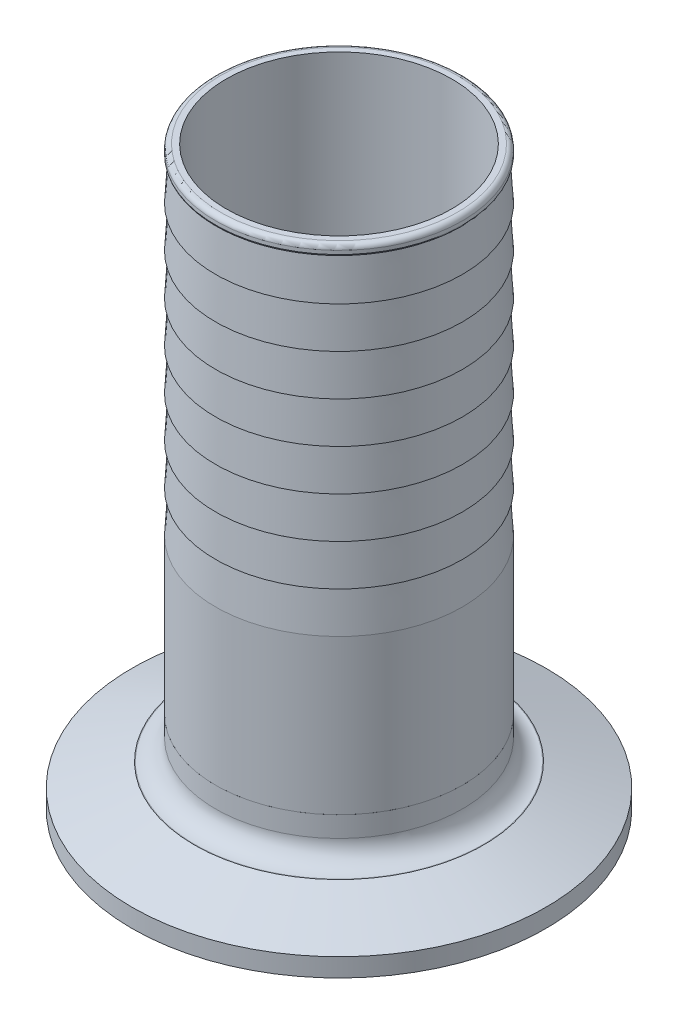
ISO-10303-21;
HEADER;
FILE_DESCRIPTION(('STEP AP214'),'2;1');
FILE_NAME('part.step','',(''),(''),'','','');
FILE_SCHEMA(('AUTOMOTIVE_DESIGN { 1 0 10303 214 1 1 1 1 }'));
ENDSEC;
DATA;
#1=APPLICATION_CONTEXT('core data for automotive mechanical design processes');
#2=APPLICATION_PROTOCOL_DEFINITION('international standard','automotive_design',2000,#1);
#3=PRODUCT_CONTEXT('',#1,'mechanical');
#4=PRODUCT('Part','Part','',(#3));
#5=PRODUCT_RELATED_PRODUCT_CATEGORY('part','',(#4));
#6=PRODUCT_DEFINITION_FORMATION('','',#4);
#7=PRODUCT_DEFINITION_CONTEXT('part definition',#1,'design');
#8=PRODUCT_DEFINITION('design','',#6,#7);
#9=PRODUCT_DEFINITION_SHAPE('','',#8);
#10=(LENGTH_UNIT() NAMED_UNIT(*) SI_UNIT(.MILLI.,.METRE.));
#11=(NAMED_UNIT(*) PLANE_ANGLE_UNIT() SI_UNIT($,.RADIAN.));
#12=(NAMED_UNIT(*) SI_UNIT($,.STERADIAN.) SOLID_ANGLE_UNIT());
#13=UNCERTAINTY_MEASURE_WITH_UNIT(LENGTH_MEASURE(1.E-05),#10,'distance_accuracy_value','');
#14=(GEOMETRIC_REPRESENTATION_CONTEXT(3) GLOBAL_UNCERTAINTY_ASSIGNED_CONTEXT((#13)) GLOBAL_UNIT_ASSIGNED_CONTEXT((#10,
#11,#12)) REPRESENTATION_CONTEXT('',''));
#15=CARTESIAN_POINT('',(0.,0.,0.));
#16=DIRECTION('',(0.,0.,1.));
#17=DIRECTION('',(1.,0.,0.));
#18=AXIS2_PLACEMENT_3D('',#15,#16,#17);
#19=CARTESIAN_POINT('',(10.9839426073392,42.2585067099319,49.2398429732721));
#20=DIRECTION('',(0.,-0.999999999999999,0.));
#21=DIRECTION('',(0.,0.,-1.));
#22=AXIS2_PLACEMENT_3D('',#19,#20,#21);
#23=PLANE('',#22);
#24=CARTESIAN_POINT('',(28.3829426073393,42.2585067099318,49.2398429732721));
#25=DIRECTION('',(0.,-0.999999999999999,0.));
#26=DIRECTION('',(0.,0.,-1.));
#27=AXIS2_PLACEMENT_3D('',#24,#25,#26);
#28=CIRCLE('',#27,19.05);
#29=CARTESIAN_POINT('',(28.3829426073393,42.2585067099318,30.189842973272));
#30=VERTEX_POINT('',#29);
#31=EDGE_CURVE('P0_E10',#30,#30,#28,.T.);
#32=ORIENTED_EDGE('',*,*,#31,.F.);
#33=EDGE_LOOP('',(#32));
#34=FACE_BOUND('',#33,.T.);
#35=CARTESIAN_POINT('',(28.3829426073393,42.2585067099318,49.2398429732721));
#36=DIRECTION('',(0.,-0.999999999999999,0.));
#37=DIRECTION('',(0.,0.,-1.));
#38=AXIS2_PLACEMENT_3D('',#35,#36,#37);
#39=CIRCLE('',#38,17.399);
#40=CARTESIAN_POINT('',(28.3829426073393,42.2585067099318,31.840842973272));
#41=VERTEX_POINT('',#40);
#42=EDGE_CURVE('P0_E64',#41,#41,#39,.T.);
#43=ORIENTED_EDGE('',*,*,#42,.T.);
#44=EDGE_LOOP('',(#43));
#45=FACE_BOUND('',#44,.T.);
#46=ADVANCED_FACE('P0_F15',(#34,#45),#23,.F.);
#47=CARTESIAN_POINT('',(28.3829426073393,29.5585067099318,49.2398429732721));
#48=DIRECTION('',(0.,-0.999999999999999,0.));
#49=DIRECTION('',(0.,0.,-1.));
#50=AXIS2_PLACEMENT_3D('',#47,#48,#49);
#51=CYLINDRICAL_SURFACE('',#50,19.05);
#52=CARTESIAN_POINT('',(28.3829426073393,39.0835067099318,49.2398429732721));
#53=DIRECTION('',(0.,-0.999999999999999,0.));
#54=DIRECTION('',(0.,0.,-1.));
#55=AXIS2_PLACEMENT_3D('',#52,#53,#54);
#56=CIRCLE('',#55,19.05);
#57=CARTESIAN_POINT('',(28.3829426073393,39.0835067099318,30.189842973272));
#58=VERTEX_POINT('',#57);
#59=EDGE_CURVE('P0_E21',#58,#58,#56,.T.);
#60=CARTESIAN_POINT('',(28.3829426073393,39.0835067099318,30.189842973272));
#61=CARTESIAN_POINT('',(28.3829426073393,39.1165796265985,30.189842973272));
#62=CARTESIAN_POINT('',(28.3829426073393,39.1496525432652,30.189842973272));
#63=CARTESIAN_POINT('',(28.3829426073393,39.2157983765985,30.189842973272));
#64=CARTESIAN_POINT('',(28.3829426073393,39.2488712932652,30.189842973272));
#65=CARTESIAN_POINT('',(28.3829426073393,39.3150171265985,30.189842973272));
#66=CARTESIAN_POINT('',(28.3829426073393,39.3480900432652,30.189842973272));
#67=CARTESIAN_POINT('',(28.3829426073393,39.4142358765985,30.189842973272));
#68=CARTESIAN_POINT('',(28.3829426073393,39.4473087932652,30.189842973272));
#69=CARTESIAN_POINT('',(28.3829426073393,39.5134546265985,30.189842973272));
#70=CARTESIAN_POINT('',(28.3829426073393,39.5465275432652,30.189842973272));
#71=CARTESIAN_POINT('',(28.3829426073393,39.6126733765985,30.189842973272));
#72=CARTESIAN_POINT('',(28.3829426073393,39.6457462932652,30.189842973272));
#73=CARTESIAN_POINT('',(28.3829426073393,39.7118921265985,30.189842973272));
#74=CARTESIAN_POINT('',(28.3829426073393,39.7449650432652,30.189842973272));
#75=CARTESIAN_POINT('',(28.3829426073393,39.8111108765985,30.189842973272));
#76=CARTESIAN_POINT('',(28.3829426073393,39.8441837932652,30.189842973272));
#77=CARTESIAN_POINT('',(28.3829426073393,39.9103296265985,30.189842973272));
#78=CARTESIAN_POINT('',(28.3829426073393,39.9434025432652,30.189842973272));
#79=CARTESIAN_POINT('',(28.3829426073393,40.0095483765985,30.189842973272));
#80=CARTESIAN_POINT('',(28.3829426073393,40.0426212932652,30.189842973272));
#81=CARTESIAN_POINT('',(28.3829426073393,40.1087671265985,30.189842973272));
#82=CARTESIAN_POINT('',(28.3829426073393,40.1418400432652,30.189842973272));
#83=CARTESIAN_POINT('',(28.3829426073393,40.2079858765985,30.189842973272));
#84=CARTESIAN_POINT('',(28.3829426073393,40.2410587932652,30.189842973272));
#85=CARTESIAN_POINT('',(28.3829426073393,40.3072046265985,30.189842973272));
#86=CARTESIAN_POINT('',(28.3829426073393,40.3402775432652,30.189842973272));
#87=CARTESIAN_POINT('',(28.3829426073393,40.4064233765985,30.189842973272));
#88=CARTESIAN_POINT('',(28.3829426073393,40.4394962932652,30.189842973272));
#89=CARTESIAN_POINT('',(28.3829426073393,40.5056421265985,30.189842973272));
#90=CARTESIAN_POINT('',(28.3829426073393,40.5387150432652,30.189842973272));
#91=CARTESIAN_POINT('',(28.3829426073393,40.6048608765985,30.189842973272));
#92=CARTESIAN_POINT('',(28.3829426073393,40.6379337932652,30.189842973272));
#93=CARTESIAN_POINT('',(28.3829426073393,40.7040796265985,30.189842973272));
#94=CARTESIAN_POINT('',(28.3829426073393,40.7371525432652,30.189842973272));
#95=CARTESIAN_POINT('',(28.3829426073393,40.8032983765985,30.189842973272));
#96=CARTESIAN_POINT('',(28.3829426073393,40.8363712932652,30.189842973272));
#97=CARTESIAN_POINT('',(28.3829426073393,40.9025171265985,30.189842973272));
#98=CARTESIAN_POINT('',(28.3829426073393,40.9355900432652,30.189842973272));
#99=CARTESIAN_POINT('',(28.3829426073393,41.0017358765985,30.189842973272));
#100=CARTESIAN_POINT('',(28.3829426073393,41.0348087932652,30.189842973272));
#101=CARTESIAN_POINT('',(28.3829426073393,41.1009546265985,30.189842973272));
#102=CARTESIAN_POINT('',(28.3829426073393,41.1340275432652,30.189842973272));
#103=CARTESIAN_POINT('',(28.3829426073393,41.2001733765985,30.189842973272));
#104=CARTESIAN_POINT('',(28.3829426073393,41.2332462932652,30.189842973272));
#105=CARTESIAN_POINT('',(28.3829426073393,41.2993921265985,30.189842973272));
#106=CARTESIAN_POINT('',(28.3829426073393,41.3324650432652,30.189842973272));
#107=CARTESIAN_POINT('',(28.3829426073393,41.3986108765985,30.189842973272));
#108=CARTESIAN_POINT('',(28.3829426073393,41.4316837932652,30.189842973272));
#109=CARTESIAN_POINT('',(28.3829426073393,41.4978296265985,30.189842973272));
#110=CARTESIAN_POINT('',(28.3829426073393,41.5309025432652,30.189842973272));
#111=CARTESIAN_POINT('',(28.3829426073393,41.5970483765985,30.189842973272));
#112=CARTESIAN_POINT('',(28.3829426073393,41.6301212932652,30.189842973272));
#113=CARTESIAN_POINT('',(28.3829426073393,41.6962671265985,30.189842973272));
#114=CARTESIAN_POINT('',(28.3829426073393,41.7293400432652,30.189842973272));
#115=CARTESIAN_POINT('',(28.3829426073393,41.7954858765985,30.189842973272));
#116=CARTESIAN_POINT('',(28.3829426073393,41.8285587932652,30.189842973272));
#117=CARTESIAN_POINT('',(28.3829426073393,41.8947046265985,30.189842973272));
#118=CARTESIAN_POINT('',(28.3829426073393,41.9277775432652,30.189842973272));
#119=CARTESIAN_POINT('',(28.3829426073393,41.9939233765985,30.189842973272));
#120=CARTESIAN_POINT('',(28.3829426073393,42.0269962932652,30.189842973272));
#121=CARTESIAN_POINT('',(28.3829426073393,42.0931421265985,30.189842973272));
#122=CARTESIAN_POINT('',(28.3829426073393,42.1262150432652,30.189842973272));
#123=CARTESIAN_POINT('',(28.3829426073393,42.1923608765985,30.189842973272));
#124=CARTESIAN_POINT('',(28.3829426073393,42.2254337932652,30.189842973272));
#125=CARTESIAN_POINT('',(28.3829426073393,42.2585067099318,30.189842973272));
#126=B_SPLINE_CURVE_WITH_KNOTS('',3,(#60,#61,#62,#63,#64,#65,#66,#67,#68,#69,#70,#71,#72,#73,
#74,#75,#76,#77,#78,#79,#80,#81,#82,#83,#84,#85,#86,#87,#88,#89,#90,#91,#92,#93,#94,#95,#96,#97,
#98,#99,#100,#101,#102,#103,#104,#105,#106,#107,#108,#109,#110,#111,#112,#113,#114,#115,#116,
#117,#118,#119,#120,#121,#122,#123,#124,#125),.UNSPECIFIED.,.F.,.F.,(4,2,2,2,2,2,2,2,2,2,2,2,2,
2,2,2,2,2,2,2,2,2,2,2,2,2,2,2,2,2,2,2,4),(0.,0.0992187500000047,0.198437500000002,0.29765625,
0.396875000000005,0.496093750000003,0.5953125,0.694531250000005,0.793750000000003,
0.892968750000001,0.992187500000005,1.09140625,1.190625,1.28984375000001,1.3890625,1.48828125,
1.58750000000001,1.68671875,1.7859375,1.88515625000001,1.984375,2.08359375,2.18281250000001,
2.28203125,2.38125,2.48046875,2.5796875,2.67890625,2.778125,2.87734375,2.9765625,3.07578125,
3.175),.UNSPECIFIED.);
#127=EDGE_CURVE('P0_BSEAM143',#58,#30,#126,.T.);
#128=ORIENTED_EDGE('',*,*,#59,.F.);
#129=ORIENTED_EDGE('',*,*,#31,.T.);
#130=ORIENTED_EDGE('',*,*,#127,.T.);
#131=ORIENTED_EDGE('',*,*,#127,.F.);
#132=EDGE_LOOP('',(#128,#130,#129,#131));
#133=FACE_BOUND('',#132,.T.);
#134=ADVANCED_FACE('P0_F143',(#133),#51,.T.);
#135=CARTESIAN_POINT('',(28.3829426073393,39.0835067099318,49.2398429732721));
#136=DIRECTION('',(0.,-0.999999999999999,0.));
#137=DIRECTION('',(0.,0.,-1.));
#138=AXIS2_PLACEMENT_3D('',#135,#136,#137);
#139=TOROIDAL_SURFACE('',#138,22.225,3.175);
#140=CARTESIAN_POINT('',(28.3829426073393,35.9085067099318,49.2398429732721));
#141=DIRECTION('',(0.,-0.999999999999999,0.));
#142=DIRECTION('',(0.,0.,-1.));
#143=AXIS2_PLACEMENT_3D('',#140,#141,#142);
#144=CIRCLE('',#143,22.225);
#145=CARTESIAN_POINT('',(28.3829426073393,35.9085067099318,27.014842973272));
#146=VERTEX_POINT('',#145);
#147=EDGE_CURVE('P0_E25',#146,#146,#144,.T.);
#148=ORIENTED_EDGE('',*,*,#147,.F.);
#149=EDGE_LOOP('',(#148));
#150=FACE_BOUND('',#149,.T.);
#151=ORIENTED_EDGE('',*,*,#59,.T.);
#152=EDGE_LOOP('',(#151));
#153=FACE_BOUND('',#152,.T.);
#154=ADVANCED_FACE('P0_F138',(#150,#153),#139,.F.);
#155=CARTESIAN_POINT('',(6.15794260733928,35.9085067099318,49.2398429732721));
#156=DIRECTION('',(0.,-0.999999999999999,0.));
#157=DIRECTION('',(0.,0.,-1.));
#158=AXIS2_PLACEMENT_3D('',#155,#156,#157);
#159=PLANE('',#158);
#160=CARTESIAN_POINT('',(28.3829426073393,35.9085067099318,49.2398429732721));
#161=DIRECTION('',(0.,-0.999999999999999,0.));
#162=DIRECTION('',(0.,0.,-1.));
#163=AXIS2_PLACEMENT_3D('',#160,#161,#162);
#164=CIRCLE('',#163,22.3227421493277);
#165=CARTESIAN_POINT('',(28.3829426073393,35.9085067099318,26.9171008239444));
#166=VERTEX_POINT('',#165);
#167=EDGE_CURVE('P0_E29',#166,#166,#164,.T.);
#168=ORIENTED_EDGE('',*,*,#167,.F.);
#169=EDGE_LOOP('',(#168));
#170=FACE_BOUND('',#169,.T.);
#171=ORIENTED_EDGE('',*,*,#147,.T.);
#172=EDGE_LOOP('',(#171));
#173=FACE_BOUND('',#172,.T.);
#174=ADVANCED_FACE('P0_F132',(#170,#173),#159,.F.);
#175=CARTESIAN_POINT('',(28.3829426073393,35.9085067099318,49.2398429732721));
#176=DIRECTION('',(0.,-0.999999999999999,0.));
#177=DIRECTION('',(0.,0.,-1.));
#178=AXIS2_PLACEMENT_3D('',#175,#176,#177);
#179=CONICAL_SURFACE('',#178,22.3227421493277,1.22173047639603);
#180=CARTESIAN_POINT('',(28.3829426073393,32.4033067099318,49.2398429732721));
#181=DIRECTION('',(0.,-0.999999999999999,0.));
#182=DIRECTION('',(0.,0.,-1.));
#183=AXIS2_PLACEMENT_3D('',#180,#181,#182);
#184=CIRCLE('',#183,31.9532);
#185=CARTESIAN_POINT('',(28.3829426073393,32.4033067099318,17.286642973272));
#186=VERTEX_POINT('',#185);
#187=EDGE_CURVE('P0_E34',#186,#186,#184,.T.);
#188=CARTESIAN_POINT('',(28.3829426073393,32.4033067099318,17.286642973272));
#189=CARTESIAN_POINT('',(28.3829426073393,32.4398192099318,17.3869602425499));
#190=CARTESIAN_POINT('',(28.3829426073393,32.4763317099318,17.4872775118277));
#191=CARTESIAN_POINT('',(28.3829426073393,32.5493567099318,17.6879120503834));
#192=CARTESIAN_POINT('',(28.3829426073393,32.5858692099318,17.7882293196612));
#193=CARTESIAN_POINT('',(28.3829426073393,32.6588942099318,17.9888638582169));
#194=CARTESIAN_POINT('',(28.3829426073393,32.6954067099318,18.0891811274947));
#195=CARTESIAN_POINT('',(28.3829426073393,32.7684317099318,18.2898156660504));
#196=CARTESIAN_POINT('',(28.3829426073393,32.8049442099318,18.3901329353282));
#197=CARTESIAN_POINT('',(28.3829426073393,32.8779692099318,18.5907674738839));
#198=CARTESIAN_POINT('',(28.3829426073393,32.9144817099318,18.6910847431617));
#199=CARTESIAN_POINT('',(28.3829426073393,32.9875067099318,18.8917192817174));
#200=CARTESIAN_POINT('',(28.3829426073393,33.0240192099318,18.9920365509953));
#201=CARTESIAN_POINT('',(28.3829426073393,33.0970442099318,19.1926710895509));
#202=CARTESIAN_POINT('',(28.3829426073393,33.1335567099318,19.2929883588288));
#203=CARTESIAN_POINT('',(28.3829426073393,33.2065817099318,19.4936228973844));
#204=CARTESIAN_POINT('',(28.3829426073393,33.2430942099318,19.5939401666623));
#205=CARTESIAN_POINT('',(28.3829426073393,33.3161192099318,19.7945747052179));
#206=CARTESIAN_POINT('',(28.3829426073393,33.3526317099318,19.8948919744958));
#207=CARTESIAN_POINT('',(28.3829426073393,33.4256567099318,20.0955265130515));
#208=CARTESIAN_POINT('',(28.3829426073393,33.4621692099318,20.1958437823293));
#209=CARTESIAN_POINT('',(28.3829426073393,33.5351942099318,20.396478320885));
#210=CARTESIAN_POINT('',(28.3829426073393,33.5717067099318,20.4967955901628));
#211=CARTESIAN_POINT('',(28.3829426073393,33.6447317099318,20.6974301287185));
#212=CARTESIAN_POINT('',(28.3829426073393,33.6812442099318,20.7977473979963));
#213=CARTESIAN_POINT('',(28.3829426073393,33.7542692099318,20.998381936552));
#214=CARTESIAN_POINT('',(28.3829426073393,33.7907817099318,21.0986992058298));
#215=CARTESIAN_POINT('',(28.3829426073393,33.8638067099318,21.2993337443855));
#216=CARTESIAN_POINT('',(28.3829426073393,33.9003192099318,21.3996510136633));
#217=CARTESIAN_POINT('',(28.3829426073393,33.9733442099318,21.600285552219));
#218=CARTESIAN_POINT('',(28.3829426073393,34.0098567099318,21.7006028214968));
#219=CARTESIAN_POINT('',(28.3829426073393,34.0828817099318,21.9012373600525));
#220=CARTESIAN_POINT('',(28.3829426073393,34.1193942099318,22.0015546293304));
#221=CARTESIAN_POINT('',(28.3829426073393,34.1924192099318,22.202189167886));
#222=CARTESIAN_POINT('',(28.3829426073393,34.2289317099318,22.3025064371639));
#223=CARTESIAN_POINT('',(28.3829426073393,34.3019567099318,22.5031409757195));
#224=CARTESIAN_POINT('',(28.3829426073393,34.3384692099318,22.6034582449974));
#225=CARTESIAN_POINT('',(28.3829426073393,34.4114942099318,22.804092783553));
#226=CARTESIAN_POINT('',(28.3829426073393,34.4480067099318,22.9044100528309));
#227=CARTESIAN_POINT('',(28.3829426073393,34.5210317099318,23.1050445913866));
#228=CARTESIAN_POINT('',(28.3829426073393,34.5575442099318,23.2053618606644));
#229=CARTESIAN_POINT('',(28.3829426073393,34.6305692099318,23.4059963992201));
#230=CARTESIAN_POINT('',(28.3829426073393,34.6670817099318,23.5063136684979));
#231=CARTESIAN_POINT('',(28.3829426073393,34.7401067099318,23.7069482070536));
#232=CARTESIAN_POINT('',(28.3829426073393,34.7766192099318,23.8072654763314));
#233=CARTESIAN_POINT('',(28.3829426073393,34.8496442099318,24.0079000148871));
#234=CARTESIAN_POINT('',(28.3829426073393,34.8861567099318,24.1082172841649));
#235=CARTESIAN_POINT('',(28.3829426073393,34.9591817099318,24.3088518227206));
#236=CARTESIAN_POINT('',(28.3829426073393,34.9956942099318,24.4091690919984));
#237=CARTESIAN_POINT('',(28.3829426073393,35.0687192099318,24.6098036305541));
#238=CARTESIAN_POINT('',(28.3829426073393,35.1052317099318,24.7101208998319));
#239=CARTESIAN_POINT('',(28.3829426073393,35.1782567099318,24.9107554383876));
#240=CARTESIAN_POINT('',(28.3829426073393,35.2147692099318,25.0110727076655));
#241=CARTESIAN_POINT('',(28.3829426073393,35.2877942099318,25.2117072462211));
#242=CARTESIAN_POINT('',(28.3829426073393,35.3243067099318,25.312024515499));
#243=CARTESIAN_POINT('',(28.3829426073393,35.3973317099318,25.5126590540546));
#244=CARTESIAN_POINT('',(28.3829426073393,35.4338442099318,25.6129763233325));
#245=CARTESIAN_POINT('',(28.3829426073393,35.5068692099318,25.8136108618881));
#246=CARTESIAN_POINT('',(28.3829426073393,35.5433817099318,25.913928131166));
#247=CARTESIAN_POINT('',(28.3829426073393,35.6164067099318,26.1145626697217));
#248=CARTESIAN_POINT('',(28.3829426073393,35.6529192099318,26.2148799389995));
#249=CARTESIAN_POINT('',(28.3829426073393,35.7259442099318,26.4155144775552));
#250=CARTESIAN_POINT('',(28.3829426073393,35.7624567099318,26.515831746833));
#251=CARTESIAN_POINT('',(28.3829426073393,35.8354817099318,26.7164662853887));
#252=CARTESIAN_POINT('',(28.3829426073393,35.8719942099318,26.8167835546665));
#253=CARTESIAN_POINT('',(28.3829426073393,35.9085067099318,26.9171008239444));
#254=B_SPLINE_CURVE_WITH_KNOTS('',3,(#188,#189,#190,#191,#192,#193,#194,#195,#196,#197,#198,
#199,#200,#201,#202,#203,#204,#205,#206,#207,#208,#209,#210,#211,#212,#213,#214,#215,#216,#217,
#218,#219,#220,#221,#222,#223,#224,#225,#226,#227,#228,#229,#230,#231,#232,#233,#234,#235,#236,
#237,#238,#239,#240,#241,#242,#243,#244,#245,#246,#247,#248,#249,#250,#251,#252,#253),
.UNSPECIFIED.,.F.,.F.,(4,2,2,2,2,2,2,2,2,2,2,2,2,2,2,2,2,2,2,2,2,2,2,2,2,2,2,2,2,2,2,2,4),(0.,
0.320266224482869,0.640532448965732,0.960798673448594,1.28106489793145,1.60133112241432,
1.92159734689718,2.24186357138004,2.56212979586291,2.88239602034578,3.20266224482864,
3.5229284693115,3.84319469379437,4.16346091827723,4.48372714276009,4.80399336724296,
5.12425959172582,5.44452581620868,5.76479204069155,6.08505826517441,6.40532448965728,
6.72559071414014,7.045856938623,7.36612316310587,7.68638938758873,8.0066556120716,
8.32692183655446,8.64718806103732,8.96745428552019,9.28772051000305,9.60798673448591,
9.92825295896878,10.2485191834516),.UNSPECIFIED.);
#255=EDGE_CURVE('P0_BSEAM126',#186,#166,#254,.T.);
#256=ORIENTED_EDGE('',*,*,#187,.F.);
#257=ORIENTED_EDGE('',*,*,#167,.T.);
#258=ORIENTED_EDGE('',*,*,#255,.T.);
#259=ORIENTED_EDGE('',*,*,#255,.F.);
#260=EDGE_LOOP('',(#256,#258,#257,#259));
#261=FACE_BOUND('',#260,.T.);
#262=ADVANCED_FACE('P0_F126',(#261),#179,.T.);
#263=CARTESIAN_POINT('',(28.3829426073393,29.5585067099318,49.2398429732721));
#264=DIRECTION('',(0.,-0.999999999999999,0.));
#265=DIRECTION('',(0.,0.,-1.));
#266=AXIS2_PLACEMENT_3D('',#263,#264,#265);
#267=CYLINDRICAL_SURFACE('',#266,31.9532);
#268=CARTESIAN_POINT('',(28.3829426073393,29.5585067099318,49.2398429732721));
#269=DIRECTION('',(0.,-0.999999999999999,0.));
#270=DIRECTION('',(0.,0.,-1.));
#271=AXIS2_PLACEMENT_3D('',#268,#269,#270);
#272=CIRCLE('',#271,31.9532);
#273=CARTESIAN_POINT('',(28.3829426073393,29.5585067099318,17.286642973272));
#274=VERTEX_POINT('',#273);
#275=EDGE_CURVE('P0_E37',#274,#274,#272,.T.);
#276=CARTESIAN_POINT('',(28.3829426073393,29.5585067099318,17.286642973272));
#277=CARTESIAN_POINT('',(28.3829426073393,29.5881400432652,17.286642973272));
#278=CARTESIAN_POINT('',(28.3829426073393,29.6177733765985,17.286642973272));
#279=CARTESIAN_POINT('',(28.3829426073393,29.6770400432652,17.286642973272));
#280=CARTESIAN_POINT('',(28.3829426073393,29.7066733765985,17.286642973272));
#281=CARTESIAN_POINT('',(28.3829426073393,29.7659400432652,17.286642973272));
#282=CARTESIAN_POINT('',(28.3829426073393,29.7955733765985,17.286642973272));
#283=CARTESIAN_POINT('',(28.3829426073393,29.8548400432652,17.286642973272));
#284=CARTESIAN_POINT('',(28.3829426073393,29.8844733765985,17.286642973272));
#285=CARTESIAN_POINT('',(28.3829426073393,29.9437400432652,17.286642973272));
#286=CARTESIAN_POINT('',(28.3829426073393,29.9733733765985,17.286642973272));
#287=CARTESIAN_POINT('',(28.3829426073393,30.0326400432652,17.286642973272));
#288=CARTESIAN_POINT('',(28.3829426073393,30.0622733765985,17.286642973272));
#289=CARTESIAN_POINT('',(28.3829426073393,30.1215400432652,17.286642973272));
#290=CARTESIAN_POINT('',(28.3829426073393,30.1511733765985,17.286642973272));
#291=CARTESIAN_POINT('',(28.3829426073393,30.2104400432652,17.286642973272));
#292=CARTESIAN_POINT('',(28.3829426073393,30.2400733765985,17.286642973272));
#293=CARTESIAN_POINT('',(28.3829426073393,30.2993400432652,17.286642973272));
#294=CARTESIAN_POINT('',(28.3829426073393,30.3289733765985,17.286642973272));
#295=CARTESIAN_POINT('',(28.3829426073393,30.3882400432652,17.286642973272));
#296=CARTESIAN_POINT('',(28.3829426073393,30.4178733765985,17.286642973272));
#297=CARTESIAN_POINT('',(28.3829426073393,30.4771400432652,17.286642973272));
#298=CARTESIAN_POINT('',(28.3829426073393,30.5067733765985,17.286642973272));
#299=CARTESIAN_POINT('',(28.3829426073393,30.5660400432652,17.286642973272));
#300=CARTESIAN_POINT('',(28.3829426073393,30.5956733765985,17.286642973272));
#301=CARTESIAN_POINT('',(28.3829426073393,30.6549400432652,17.286642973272));
#302=CARTESIAN_POINT('',(28.3829426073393,30.6845733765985,17.286642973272));
#303=CARTESIAN_POINT('',(28.3829426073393,30.7438400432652,17.286642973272));
#304=CARTESIAN_POINT('',(28.3829426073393,30.7734733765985,17.286642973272));
#305=CARTESIAN_POINT('',(28.3829426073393,30.8327400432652,17.286642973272));
#306=CARTESIAN_POINT('',(28.3829426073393,30.8623733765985,17.286642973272));
#307=CARTESIAN_POINT('',(28.3829426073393,30.9216400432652,17.286642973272));
#308=CARTESIAN_POINT('',(28.3829426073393,30.9512733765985,17.286642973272));
#309=CARTESIAN_POINT('',(28.3829426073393,31.0105400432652,17.286642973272));
#310=CARTESIAN_POINT('',(28.3829426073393,31.0401733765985,17.286642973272));
#311=CARTESIAN_POINT('',(28.3829426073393,31.0994400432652,17.286642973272));
#312=CARTESIAN_POINT('',(28.3829426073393,31.1290733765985,17.286642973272));
#313=CARTESIAN_POINT('',(28.3829426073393,31.1883400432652,17.286642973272));
#314=CARTESIAN_POINT('',(28.3829426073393,31.2179733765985,17.286642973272));
#315=CARTESIAN_POINT('',(28.3829426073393,31.2772400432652,17.286642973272));
#316=CARTESIAN_POINT('',(28.3829426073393,31.3068733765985,17.286642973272));
#317=CARTESIAN_POINT('',(28.3829426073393,31.3661400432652,17.286642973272));
#318=CARTESIAN_POINT('',(28.3829426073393,31.3957733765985,17.286642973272));
#319=CARTESIAN_POINT('',(28.3829426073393,31.4550400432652,17.286642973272));
#320=CARTESIAN_POINT('',(28.3829426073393,31.4846733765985,17.286642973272));
#321=CARTESIAN_POINT('',(28.3829426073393,31.5439400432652,17.286642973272));
#322=CARTESIAN_POINT('',(28.3829426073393,31.5735733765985,17.286642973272));
#323=CARTESIAN_POINT('',(28.3829426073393,31.6328400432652,17.286642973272));
#324=CARTESIAN_POINT('',(28.3829426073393,31.6624733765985,17.286642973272));
#325=CARTESIAN_POINT('',(28.3829426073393,31.7217400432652,17.286642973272));
#326=CARTESIAN_POINT('',(28.3829426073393,31.7513733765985,17.286642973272));
#327=CARTESIAN_POINT('',(28.3829426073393,31.8106400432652,17.286642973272));
#328=CARTESIAN_POINT('',(28.3829426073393,31.8402733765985,17.286642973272));
#329=CARTESIAN_POINT('',(28.3829426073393,31.8995400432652,17.286642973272));
#330=CARTESIAN_POINT('',(28.3829426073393,31.9291733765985,17.286642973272));
#331=CARTESIAN_POINT('',(28.3829426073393,31.9884400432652,17.286642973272));
#332=CARTESIAN_POINT('',(28.3829426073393,32.0180733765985,17.286642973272));
#333=CARTESIAN_POINT('',(28.3829426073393,32.0773400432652,17.286642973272));
#334=CARTESIAN_POINT('',(28.3829426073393,32.1069733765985,17.286642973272));
#335=CARTESIAN_POINT('',(28.3829426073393,32.1662400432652,17.286642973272));
#336=CARTESIAN_POINT('',(28.3829426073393,32.1958733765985,17.286642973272));
#337=CARTESIAN_POINT('',(28.3829426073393,32.2551400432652,17.286642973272));
#338=CARTESIAN_POINT('',(28.3829426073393,32.2847733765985,17.286642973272));
#339=CARTESIAN_POINT('',(28.3829426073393,32.3440400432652,17.286642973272));
#340=CARTESIAN_POINT('',(28.3829426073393,32.3736733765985,17.286642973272));
#341=CARTESIAN_POINT('',(28.3829426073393,32.4033067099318,17.286642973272));
#342=B_SPLINE_CURVE_WITH_KNOTS('',3,(#276,#277,#278,#279,#280,#281,#282,#283,#284,#285,#286,
#287,#288,#289,#290,#291,#292,#293,#294,#295,#296,#297,#298,#299,#300,#301,#302,#303,#304,#305,
#306,#307,#308,#309,#310,#311,#312,#313,#314,#315,#316,#317,#318,#319,#320,#321,#322,#323,#324,
#325,#326,#327,#328,#329,#330,#331,#332,#333,#334,#335,#336,#337,#338,#339,#340,#341),
.UNSPECIFIED.,.F.,.F.,(4,2,2,2,2,2,2,2,2,2,2,2,2,2,2,2,2,2,2,2,2,2,2,2,2,2,2,2,2,2,2,2,4),(0.,
0.0888999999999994,0.177799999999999,0.266699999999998,0.355599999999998,0.444499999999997,
0.533399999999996,0.622299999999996,0.711199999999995,0.800099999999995,0.888999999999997,
0.977899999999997,1.0668,1.1557,1.2446,1.33349999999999,1.42239999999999,1.51129999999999,
1.60019999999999,1.68909999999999,1.77799999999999,1.86689999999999,1.95579999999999,
2.04469999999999,2.13359999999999,2.2225,2.31139999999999,2.40029999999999,2.48919999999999,
2.57809999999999,2.66699999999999,2.75589999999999,2.84479999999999),.UNSPECIFIED.);
#343=EDGE_CURVE('P0_BSEAM120',#274,#186,#342,.T.);
#344=ORIENTED_EDGE('',*,*,#275,.F.);
#345=ORIENTED_EDGE('',*,*,#187,.T.);
#346=ORIENTED_EDGE('',*,*,#343,.T.);
#347=ORIENTED_EDGE('',*,*,#343,.F.);
#348=EDGE_LOOP('',(#344,#346,#345,#347));
#349=FACE_BOUND('',#348,.T.);
#350=ADVANCED_FACE('P0_F120',(#349),#267,.T.);
#351=CARTESIAN_POINT('',(28.3829426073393,29.5585067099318,49.2398429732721));
#352=DIRECTION('',(0.,-0.999999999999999,0.));
#353=DIRECTION('',(0.,0.,-1.));
#354=AXIS2_PLACEMENT_3D('',#351,#352,#353);
#355=CONICAL_SURFACE('',#354,31.9532,1.56939586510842);
#356=CARTESIAN_POINT('',(28.3829426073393,29.5610191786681,49.2398429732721));
#357=DIRECTION('',(0.,-0.999999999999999,0.));
#358=DIRECTION('',(0.,0.,-1.));
#359=AXIS2_PLACEMENT_3D('',#356,#357,#358);
#360=CIRCLE('',#359,30.1591722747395);
#361=CARTESIAN_POINT('',(28.3829426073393,29.5610191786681,19.0806706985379));
#362=VERTEX_POINT('',#361);
#363=EDGE_CURVE('P0_E40',#362,#362,#360,.T.);
#364=CARTESIAN_POINT('',(28.3829426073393,29.5610191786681,19.0806706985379));
#365=CARTESIAN_POINT('',(28.3829426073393,29.5609930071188,19.0619829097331));
#366=CARTESIAN_POINT('',(28.3829426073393,29.5609668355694,19.0432951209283));
#367=CARTESIAN_POINT('',(28.3829426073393,29.5609144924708,19.0059195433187));
#368=CARTESIAN_POINT('',(28.3829426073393,29.5608883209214,18.9872317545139));
#369=CARTESIAN_POINT('',(28.3829426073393,29.5608359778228,18.9498561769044));
#370=CARTESIAN_POINT('',(28.3829426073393,29.5608098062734,18.9311683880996));
#371=CARTESIAN_POINT('',(28.3829426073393,29.5607574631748,18.89379281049));
#372=CARTESIAN_POINT('',(28.3829426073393,29.5607312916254,18.8751050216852));
#373=CARTESIAN_POINT('',(28.3829426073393,29.5606789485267,18.8377294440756));
#374=CARTESIAN_POINT('',(28.3829426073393,29.5606527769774,18.8190416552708));
#375=CARTESIAN_POINT('',(28.3829426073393,29.5606004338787,18.7816660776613));
#376=CARTESIAN_POINT('',(28.3829426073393,29.5605742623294,18.7629782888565));
#377=CARTESIAN_POINT('',(28.3829426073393,29.5605219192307,18.7256027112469));
#378=CARTESIAN_POINT('',(28.3829426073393,29.5604957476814,18.7069149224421));
#379=CARTESIAN_POINT('',(28.3829426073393,29.5604434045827,18.6695393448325));
#380=CARTESIAN_POINT('',(28.3829426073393,29.5604172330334,18.6508515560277));
#381=CARTESIAN_POINT('',(28.3829426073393,29.5603648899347,18.6134759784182));
#382=CARTESIAN_POINT('',(28.3829426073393,29.5603387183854,18.5947881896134));
#383=CARTESIAN_POINT('',(28.3829426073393,29.5602863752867,18.5574126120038));
#384=CARTESIAN_POINT('',(28.3829426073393,29.5602602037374,18.538724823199));
#385=CARTESIAN_POINT('',(28.3829426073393,29.5602078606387,18.5013492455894));
#386=CARTESIAN_POINT('',(28.3829426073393,29.5601816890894,18.4826614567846));
#387=CARTESIAN_POINT('',(28.3829426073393,29.5601293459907,18.4452858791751));
#388=CARTESIAN_POINT('',(28.3829426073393,29.5601031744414,18.4265980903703));
#389=CARTESIAN_POINT('',(28.3829426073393,29.5600508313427,18.3892225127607));
#390=CARTESIAN_POINT('',(28.3829426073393,29.5600246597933,18.3705347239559));
#391=CARTESIAN_POINT('',(28.3829426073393,29.5599723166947,18.3331591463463));
#392=CARTESIAN_POINT('',(28.3829426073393,29.5599461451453,18.3144713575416));
#393=CARTESIAN_POINT('',(28.3829426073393,29.5598938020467,18.277095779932));
#394=CARTESIAN_POINT('',(28.3829426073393,29.5598676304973,18.2584079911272));
#395=CARTESIAN_POINT('',(28.3829426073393,29.5598152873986,18.2210324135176));
#396=CARTESIAN_POINT('',(28.3829426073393,29.5597891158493,18.2023446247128));
#397=CARTESIAN_POINT('',(28.3829426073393,29.5597367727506,18.1649690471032));
#398=CARTESIAN_POINT('',(28.3829426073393,29.5597106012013,18.1462812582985));
#399=CARTESIAN_POINT('',(28.3829426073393,29.5596582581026,18.1089056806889));
#400=CARTESIAN_POINT('',(28.3829426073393,29.5596320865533,18.0902178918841));
#401=CARTESIAN_POINT('',(28.3829426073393,29.5595797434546,18.0528423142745));
#402=CARTESIAN_POINT('',(28.3829426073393,29.5595535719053,18.0341545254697));
#403=CARTESIAN_POINT('',(28.3829426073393,29.5595012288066,17.9967789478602));
#404=CARTESIAN_POINT('',(28.3829426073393,29.5594750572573,17.9780911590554));
#405=CARTESIAN_POINT('',(28.3829426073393,29.5594227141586,17.9407155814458));
#406=CARTESIAN_POINT('',(28.3829426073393,29.5593965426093,17.922027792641));
#407=CARTESIAN_POINT('',(28.3829426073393,29.5593441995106,17.8846522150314));
#408=CARTESIAN_POINT('',(28.3829426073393,29.5593180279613,17.8659644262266));
#409=CARTESIAN_POINT('',(28.3829426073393,29.5592656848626,17.8285888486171));
#410=CARTESIAN_POINT('',(28.3829426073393,29.5592395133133,17.8099010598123));
#411=CARTESIAN_POINT('',(28.3829426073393,29.5591871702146,17.7725254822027));
#412=CARTESIAN_POINT('',(28.3829426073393,29.5591609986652,17.7538376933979));
#413=CARTESIAN_POINT('',(28.3829426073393,29.5591086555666,17.7164621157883));
#414=CARTESIAN_POINT('',(28.3829426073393,29.5590824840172,17.6977743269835));
#415=CARTESIAN_POINT('',(28.3829426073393,29.5590301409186,17.660398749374));
#416=CARTESIAN_POINT('',(28.3829426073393,29.5590039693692,17.6417109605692));
#417=CARTESIAN_POINT('',(28.3829426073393,29.5589516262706,17.6043353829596));
#418=CARTESIAN_POINT('',(28.3829426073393,29.5589254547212,17.5856475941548));
#419=CARTESIAN_POINT('',(28.3829426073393,29.5588731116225,17.5482720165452));
#420=CARTESIAN_POINT('',(28.3829426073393,29.5588469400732,17.5295842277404));
#421=CARTESIAN_POINT('',(28.3829426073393,29.5587945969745,17.4922086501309));
#422=CARTESIAN_POINT('',(28.3829426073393,29.5587684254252,17.4735208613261));
#423=CARTESIAN_POINT('',(28.3829426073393,29.5587160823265,17.4361452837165));
#424=CARTESIAN_POINT('',(28.3829426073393,29.5586899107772,17.4174574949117));
#425=CARTESIAN_POINT('',(28.3829426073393,29.5586375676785,17.3800819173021));
#426=CARTESIAN_POINT('',(28.3829426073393,29.5586113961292,17.3613941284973));
#427=CARTESIAN_POINT('',(28.3829426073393,29.5585590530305,17.3240185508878));
#428=CARTESIAN_POINT('',(28.3829426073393,29.5585328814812,17.305330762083));
#429=CARTESIAN_POINT('',(28.3829426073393,29.5585067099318,17.2866429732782));
#430=B_SPLINE_CURVE_WITH_KNOTS('',3,(#364,#365,#366,#367,#368,#369,#370,#371,#372,#373,#374,
#375,#376,#377,#378,#379,#380,#381,#382,#383,#384,#385,#386,#387,#388,#389,#390,#391,#392,#393,
#394,#395,#396,#397,#398,#399,#400,#401,#402,#403,#404,#405,#406,#407,#408,#409,#410,#411,#412,
#413,#414,#415,#416,#417,#418,#419,#420,#421,#422,#423,#424,#425,#426,#427,#428,#429),
.UNSPECIFIED.,.F.,.F.,(4,2,2,2,2,2,2,2,2,2,2,2,2,2,2,2,2,2,2,2,2,2,2,2,2,2,2,2,2,2,2,2,4),(0.,
0.0560634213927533,0.112126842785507,0.16819026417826,0.22425368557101,0.280317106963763,
0.336380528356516,0.39244394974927,0.44850737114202,0.504570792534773,0.560634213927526,
0.616697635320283,0.672761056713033,0.728824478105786,0.78488789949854,0.840951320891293,
0.897014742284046,0.953078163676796,1.00914158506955,1.0652050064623,1.12126842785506,
1.17733184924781,1.23339527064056,1.28945869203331,1.34552211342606,1.40158553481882,
1.45764895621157,1.51371237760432,1.56977579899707,1.62583922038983,1.68190264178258,
1.73796606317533,1.79402948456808),.UNSPECIFIED.);
#431=EDGE_CURVE('P0_BSEAM114',#362,#274,#430,.T.);
#432=ORIENTED_EDGE('',*,*,#363,.F.);
#433=ORIENTED_EDGE('',*,*,#275,.T.);
#434=ORIENTED_EDGE('',*,*,#431,.T.);
#435=ORIENTED_EDGE('',*,*,#431,.F.);
#436=EDGE_LOOP('',(#432,#434,#433,#435));
#437=FACE_BOUND('',#436,.T.);
#438=ADVANCED_FACE('P0_F114',(#437),#355,.F.);
#439=CARTESIAN_POINT('',(28.3829426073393,30.3484191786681,49.2398429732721));
#440=DIRECTION('',(0.,-0.999999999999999,0.));
#441=DIRECTION('',(0.,0.,-1.));
#442=AXIS2_PLACEMENT_3D('',#439,#440,#441);
#443=TOROIDAL_SURFACE('',#442,30.1591722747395,0.787400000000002);
#444=CARTESIAN_POINT('',(28.3829426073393,30.0407574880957,49.2398429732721));
#445=DIRECTION('',(0.,-0.999999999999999,0.));
#446=DIRECTION('',(0.,0.,-1.));
#447=AXIS2_PLACEMENT_3D('',#444,#445,#446);
#448=CIRCLE('',#447,29.434366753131);
#449=CARTESIAN_POINT('',(28.3829426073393,30.0407574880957,19.805476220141));
#450=VERTEX_POINT('',#449);
#451=EDGE_CURVE('P0_E43',#450,#450,#448,.T.);
#452=ORIENTED_EDGE('',*,*,#451,.F.);
#453=EDGE_LOOP('',(#452));
#454=FACE_BOUND('',#453,.T.);
#455=ORIENTED_EDGE('',*,*,#363,.T.);
#456=EDGE_LOOP('',(#455));
#457=FACE_BOUND('',#456,.T.);
#458=ADVANCED_FACE('P0_F108',(#454,#457),#443,.T.);
#459=CARTESIAN_POINT('',(28.3829426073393,30.0407574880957,49.2398429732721));
#460=DIRECTION('',(0.,-0.999999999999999,0.));
#461=DIRECTION('',(0.,0.,-1.));
#462=AXIS2_PLACEMENT_3D('',#459,#460,#461);
#463=CONICAL_SURFACE('',#462,29.434366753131,0.401425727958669);
#464=CARTESIAN_POINT('',(28.3829426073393,30.4338739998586,49.2398429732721));
#465=DIRECTION('',(0.,-0.999999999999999,0.));
#466=DIRECTION('',(0.,0.,-1.));
#467=AXIS2_PLACEMENT_3D('',#464,#465,#466);
#468=CIRCLE('',#467,29.2674986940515);
#469=CARTESIAN_POINT('',(28.3829426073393,30.4338739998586,19.9723442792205));
#470=VERTEX_POINT('',#469);
#471=EDGE_CURVE('P0_E46',#470,#470,#468,.T.);
#472=CARTESIAN_POINT('',(28.3829426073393,30.4338739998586,19.9723442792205));
#473=CARTESIAN_POINT('',(28.3829426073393,30.4297790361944,19.9706060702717));
#474=CARTESIAN_POINT('',(28.3829426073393,30.4256840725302,19.968867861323));
#475=CARTESIAN_POINT('',(28.3829426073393,30.4174941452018,19.9653914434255));
#476=CARTESIAN_POINT('',(28.3829426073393,30.4133991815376,19.9636532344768));
#477=CARTESIAN_POINT('',(28.3829426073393,30.4052092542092,19.9601768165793));
#478=CARTESIAN_POINT('',(28.3829426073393,30.401114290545,19.9584386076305));
#479=CARTESIAN_POINT('',(28.3829426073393,30.3929243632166,19.954962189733));
#480=CARTESIAN_POINT('',(28.3829426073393,30.3888293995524,19.9532239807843));
#481=CARTESIAN_POINT('',(28.3829426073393,30.380639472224,19.9497475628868));
#482=CARTESIAN_POINT('',(28.3829426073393,30.3765445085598,19.948009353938));
#483=CARTESIAN_POINT('',(28.3829426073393,30.3683545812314,19.9445329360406));
#484=CARTESIAN_POINT('',(28.3829426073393,30.3642596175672,19.9427947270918));
#485=CARTESIAN_POINT('',(28.3829426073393,30.3560696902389,19.9393183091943));
#486=CARTESIAN_POINT('',(28.3829426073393,30.3519747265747,19.9375801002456));
#487=CARTESIAN_POINT('',(28.3829426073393,30.3437847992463,19.9341036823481));
#488=CARTESIAN_POINT('',(28.3829426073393,30.3396898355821,19.9323654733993));
#489=CARTESIAN_POINT('',(28.3829426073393,30.3314999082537,19.9288890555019));
#490=CARTESIAN_POINT('',(28.3829426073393,30.3274049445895,19.9271508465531));
#491=CARTESIAN_POINT('',(28.3829426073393,30.3192150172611,19.9236744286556));
#492=CARTESIAN_POINT('',(28.3829426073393,30.3151200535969,19.9219362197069));
#493=CARTESIAN_POINT('',(28.3829426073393,30.3069301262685,19.9184598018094));
#494=CARTESIAN_POINT('',(28.3829426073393,30.3028351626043,19.9167215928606));
#495=CARTESIAN_POINT('',(28.3829426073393,30.2946452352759,19.9132451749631));
#496=CARTESIAN_POINT('',(28.3829426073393,30.2905502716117,19.9115069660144));
#497=CARTESIAN_POINT('',(28.3829426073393,30.2823603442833,19.9080305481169));
#498=CARTESIAN_POINT('',(28.3829426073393,30.2782653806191,19.9062923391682));
#499=CARTESIAN_POINT('',(28.3829426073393,30.2700754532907,19.9028159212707));
#500=CARTESIAN_POINT('',(28.3829426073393,30.2659804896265,19.9010777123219));
#501=CARTESIAN_POINT('',(28.3829426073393,30.2577905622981,19.8976012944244));
#502=CARTESIAN_POINT('',(28.3829426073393,30.2536955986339,19.8958630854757));
#503=CARTESIAN_POINT('',(28.3829426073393,30.2455056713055,19.8923866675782));
#504=CARTESIAN_POINT('',(28.3829426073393,30.2414107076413,19.8906484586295));
#505=CARTESIAN_POINT('',(28.3829426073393,30.2332207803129,19.887172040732));
#506=CARTESIAN_POINT('',(28.3829426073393,30.2291258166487,19.8854338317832));
#507=CARTESIAN_POINT('',(28.3829426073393,30.2209358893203,19.8819574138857));
#508=CARTESIAN_POINT('',(28.3829426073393,30.2168409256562,19.880219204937));
#509=CARTESIAN_POINT('',(28.3829426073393,30.2086509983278,19.8767427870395));
#510=CARTESIAN_POINT('',(28.3829426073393,30.2045560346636,19.8750045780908));
#511=CARTESIAN_POINT('',(28.3829426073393,30.1963661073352,19.8715281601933));
#512=CARTESIAN_POINT('',(28.3829426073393,30.192271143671,19.8697899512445));
#513=CARTESIAN_POINT('',(28.3829426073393,30.1840812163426,19.866313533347));
#514=CARTESIAN_POINT('',(28.3829426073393,30.1799862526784,19.8645753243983));
#515=CARTESIAN_POINT('',(28.3829426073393,30.17179632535,19.8610989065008));
#516=CARTESIAN_POINT('',(28.3829426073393,30.1677013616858,19.8593606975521));
#517=CARTESIAN_POINT('',(28.3829426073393,30.1595114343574,19.8558842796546));
#518=CARTESIAN_POINT('',(28.3829426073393,30.1554164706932,19.8541460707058));
#519=CARTESIAN_POINT('',(28.3829426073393,30.1472265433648,19.8506696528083));
#520=CARTESIAN_POINT('',(28.3829426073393,30.1431315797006,19.8489314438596));
#521=CARTESIAN_POINT('',(28.3829426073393,30.1349416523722,19.8454550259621));
#522=CARTESIAN_POINT('',(28.3829426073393,30.130846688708,19.8437168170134));
#523=CARTESIAN_POINT('',(28.3829426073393,30.1226567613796,19.8402403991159));
#524=CARTESIAN_POINT('',(28.3829426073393,30.1185617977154,19.8385021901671));
#525=CARTESIAN_POINT('',(28.3829426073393,30.110371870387,19.8350257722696));
#526=CARTESIAN_POINT('',(28.3829426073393,30.1062769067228,19.8332875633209));
#527=CARTESIAN_POINT('',(28.3829426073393,30.0980869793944,19.8298111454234));
#528=CARTESIAN_POINT('',(28.3829426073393,30.0939920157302,19.8280729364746));
#529=CARTESIAN_POINT('',(28.3829426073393,30.0858020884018,19.8245965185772));
#530=CARTESIAN_POINT('',(28.3829426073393,30.0817071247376,19.8228583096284));
#531=CARTESIAN_POINT('',(28.3829426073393,30.0735171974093,19.8193818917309));
#532=CARTESIAN_POINT('',(28.3829426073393,30.0694222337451,19.8176436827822));
#533=CARTESIAN_POINT('',(28.3829426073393,30.0612323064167,19.8141672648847));
#534=CARTESIAN_POINT('',(28.3829426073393,30.0571373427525,19.8124290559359));
#535=CARTESIAN_POINT('',(28.3829426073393,30.0489474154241,19.8089526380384));
#536=CARTESIAN_POINT('',(28.3829426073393,30.0448524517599,19.8072144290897));
#537=CARTESIAN_POINT('',(28.3829426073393,30.0407574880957,19.805476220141));
#538=B_SPLINE_CURVE_WITH_KNOTS('',3,(#472,#473,#474,#475,#476,#477,#478,#479,#480,#481,#482,
#483,#484,#485,#486,#487,#488,#489,#490,#491,#492,#493,#494,#495,#496,#497,#498,#499,#500,#501,
#502,#503,#504,#505,#506,#507,#508,#509,#510,#511,#512,#513,#514,#515,#516,#517,#518,#519,#520,
#521,#522,#523,#524,#525,#526,#527,#528,#529,#530,#531,#532,#533,#534,#535,#536,#537),
.UNSPECIFIED.,.F.,.F.,(4,2,2,2,2,2,2,2,2,2,2,2,2,2,2,2,2,2,2,2,2,2,2,2,2,2,2,2,2,2,2,2,4),(0.,
0.0133458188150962,0.0266916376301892,0.0400374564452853,0.0533832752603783,0.0667290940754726,
0.0800749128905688,0.0934207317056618,0.106766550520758,0.120112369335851,0.133458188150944,
0.14680400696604,0.160149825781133,0.173495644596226,0.186841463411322,0.200187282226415,
0.21353310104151,0.226878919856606,0.240224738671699,0.253570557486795,0.266916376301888,
0.280262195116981,0.293608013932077,0.30695383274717,0.320299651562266,0.333645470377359,
0.346991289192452,0.36033710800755,0.373682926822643,0.387028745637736,0.400374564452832,
0.413720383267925,0.427066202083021),.UNSPECIFIED.);
#539=EDGE_CURVE('P0_BSEAM102',#470,#450,#538,.T.);
#540=ORIENTED_EDGE('',*,*,#471,.F.);
#541=ORIENTED_EDGE('',*,*,#451,.T.);
#542=ORIENTED_EDGE('',*,*,#539,.T.);
#543=ORIENTED_EDGE('',*,*,#539,.F.);
#544=EDGE_LOOP('',(#540,#542,#541,#543));
#545=FACE_BOUND('',#544,.T.);
#546=ADVANCED_FACE('P0_F102',(#545),#463,.F.);
#547=CARTESIAN_POINT('',(28.3829426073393,29.9674191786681,49.2398429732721));
#548=DIRECTION('',(0.,-0.999999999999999,0.));
#549=DIRECTION('',(0.,0.,-1.));
#550=AXIS2_PLACEMENT_3D('',#547,#548,#549);
#551=TOROIDAL_SURFACE('',#550,28.1686,1.1938);
#552=CARTESIAN_POINT('',(28.3829426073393,30.4338739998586,49.2398429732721));
#553=DIRECTION('',(0.,-0.999999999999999,0.));
#554=DIRECTION('',(0.,0.,-1.));
#555=AXIS2_PLACEMENT_3D('',#552,#553,#554);
#556=CIRCLE('',#555,27.0697013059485);
#557=CARTESIAN_POINT('',(28.3829426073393,30.4338739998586,76.3095442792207));
#558=VERTEX_POINT('',#557);
#559=EDGE_CURVE('P0_E49',#558,#558,#556,.T.);
#560=ORIENTED_EDGE('',*,*,#559,.F.);
#561=EDGE_LOOP('',(#560));
#562=FACE_BOUND('',#561,.T.);
#563=ORIENTED_EDGE('',*,*,#471,.T.);
#564=EDGE_LOOP('',(#563));
#565=FACE_BOUND('',#564,.T.);
#566=ADVANCED_FACE('P0_F96',(#562,#565),#551,.F.);
#567=CARTESIAN_POINT('',(28.3829426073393,30.4338739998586,49.2398429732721));
#568=DIRECTION('',(0.,0.999999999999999,0.));
#569=DIRECTION('',(0.,0.,1.));
#570=AXIS2_PLACEMENT_3D('',#567,#568,#569);
#571=CONICAL_SURFACE('',#570,27.0697013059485,0.401425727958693);
#572=CARTESIAN_POINT('',(28.3829426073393,30.0407574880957,49.2398429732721));
#573=DIRECTION('',(0.,-0.999999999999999,0.));
#574=DIRECTION('',(0.,0.,-1.));
#575=AXIS2_PLACEMENT_3D('',#572,#573,#574);
#576=CIRCLE('',#575,26.9028332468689);
#577=CARTESIAN_POINT('',(28.3829426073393,30.0407574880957,76.1426762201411));
#578=VERTEX_POINT('',#577);
#579=EDGE_CURVE('P0_E52',#578,#578,#576,.T.);
#580=CARTESIAN_POINT('',(28.3829426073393,30.0407574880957,76.1426762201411));
#581=CARTESIAN_POINT('',(28.3829426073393,30.0448524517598,76.1444144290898));
#582=CARTESIAN_POINT('',(28.3829426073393,30.048947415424,76.1461526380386));
#583=CARTESIAN_POINT('',(28.3829426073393,30.0571373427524,76.1496290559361));
#584=CARTESIAN_POINT('',(28.3829426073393,30.0612323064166,76.1513672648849));
#585=CARTESIAN_POINT('',(28.3829426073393,30.069422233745,76.1548436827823));
#586=CARTESIAN_POINT('',(28.3829426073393,30.0735171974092,76.1565818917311));
#587=CARTESIAN_POINT('',(28.3829426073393,30.0817071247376,76.1600583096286));
#588=CARTESIAN_POINT('',(28.3829426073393,30.0858020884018,76.1617965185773));
#589=CARTESIAN_POINT('',(28.3829426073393,30.0939920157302,76.1652729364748));
#590=CARTESIAN_POINT('',(28.3829426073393,30.0980869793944,76.1670111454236));
#591=CARTESIAN_POINT('',(28.3829426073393,30.1062769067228,76.170487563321));
#592=CARTESIAN_POINT('',(28.3829426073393,30.110371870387,76.1722257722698));
#593=CARTESIAN_POINT('',(28.3829426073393,30.1185617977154,76.1757021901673));
#594=CARTESIAN_POINT('',(28.3829426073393,30.1226567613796,76.177440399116));
#595=CARTESIAN_POINT('',(28.3829426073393,30.130846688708,76.1809168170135));
#596=CARTESIAN_POINT('',(28.3829426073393,30.1349416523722,76.1826550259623));
#597=CARTESIAN_POINT('',(28.3829426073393,30.1431315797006,76.1861314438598));
#598=CARTESIAN_POINT('',(28.3829426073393,30.1472265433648,76.1878696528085));
#599=CARTESIAN_POINT('',(28.3829426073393,30.1554164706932,76.191346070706));
#600=CARTESIAN_POINT('',(28.3829426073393,30.1595114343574,76.1930842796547));
#601=CARTESIAN_POINT('',(28.3829426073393,30.1677013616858,76.1965606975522));
#602=CARTESIAN_POINT('',(28.3829426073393,30.17179632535,76.198298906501));
#603=CARTESIAN_POINT('',(28.3829426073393,30.1799862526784,76.2017753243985));
#604=CARTESIAN_POINT('',(28.3829426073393,30.1840812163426,76.2035135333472));
#605=CARTESIAN_POINT('',(28.3829426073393,30.192271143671,76.2069899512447));
#606=CARTESIAN_POINT('',(28.3829426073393,30.1963661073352,76.2087281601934));
#607=CARTESIAN_POINT('',(28.3829426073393,30.2045560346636,76.2122045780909));
#608=CARTESIAN_POINT('',(28.3829426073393,30.2086509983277,76.2139427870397));
#609=CARTESIAN_POINT('',(28.3829426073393,30.2168409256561,76.2174192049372));
#610=CARTESIAN_POINT('',(28.3829426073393,30.2209358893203,76.2191574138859));
#611=CARTESIAN_POINT('',(28.3829426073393,30.2291258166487,76.2226338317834));
#612=CARTESIAN_POINT('',(28.3829426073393,30.2332207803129,76.2243720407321));
#613=CARTESIAN_POINT('',(28.3829426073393,30.2414107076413,76.2278484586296));
#614=CARTESIAN_POINT('',(28.3829426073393,30.2455056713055,76.2295866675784));
#615=CARTESIAN_POINT('',(28.3829426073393,30.2536955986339,76.2330630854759));
#616=CARTESIAN_POINT('',(28.3829426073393,30.2577905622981,76.2348012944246));
#617=CARTESIAN_POINT('',(28.3829426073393,30.2659804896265,76.2382777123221));
#618=CARTESIAN_POINT('',(28.3829426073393,30.2700754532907,76.2400159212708));
#619=CARTESIAN_POINT('',(28.3829426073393,30.2782653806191,76.2434923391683));
#620=CARTESIAN_POINT('',(28.3829426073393,30.2823603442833,76.2452305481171));
#621=CARTESIAN_POINT('',(28.3829426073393,30.2905502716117,76.2487069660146));
#622=CARTESIAN_POINT('',(28.3829426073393,30.2946452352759,76.2504451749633));
#623=CARTESIAN_POINT('',(28.3829426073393,30.3028351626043,76.2539215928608));
#624=CARTESIAN_POINT('',(28.3829426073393,30.3069301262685,76.2556598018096));
#625=CARTESIAN_POINT('',(28.3829426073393,30.3151200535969,76.259136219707));
#626=CARTESIAN_POINT('',(28.3829426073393,30.3192150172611,76.2608744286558));
#627=CARTESIAN_POINT('',(28.3829426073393,30.3274049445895,76.2643508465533));
#628=CARTESIAN_POINT('',(28.3829426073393,30.3314999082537,76.266089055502));
#629=CARTESIAN_POINT('',(28.3829426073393,30.3396898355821,76.2695654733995));
#630=CARTESIAN_POINT('',(28.3829426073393,30.3437847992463,76.2713036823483));
#631=CARTESIAN_POINT('',(28.3829426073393,30.3519747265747,76.2747801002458));
#632=CARTESIAN_POINT('',(28.3829426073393,30.3560696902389,76.2765183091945));
#633=CARTESIAN_POINT('',(28.3829426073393,30.3642596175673,76.279994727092));
#634=CARTESIAN_POINT('',(28.3829426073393,30.3683545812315,76.2817329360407));
#635=CARTESIAN_POINT('',(28.3829426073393,30.3765445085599,76.2852093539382));
#636=CARTESIAN_POINT('',(28.3829426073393,30.3806394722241,76.286947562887));
#637=CARTESIAN_POINT('',(28.3829426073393,30.3888293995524,76.2904239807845));
#638=CARTESIAN_POINT('',(28.3829426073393,30.3929243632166,76.2921621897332));
#639=CARTESIAN_POINT('',(28.3829426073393,30.401114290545,76.2956386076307));
#640=CARTESIAN_POINT('',(28.3829426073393,30.4052092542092,76.2973768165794));
#641=CARTESIAN_POINT('',(28.3829426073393,30.4133991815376,76.3008532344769));
#642=CARTESIAN_POINT('',(28.3829426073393,30.4174941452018,76.3025914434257));
#643=CARTESIAN_POINT('',(28.3829426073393,30.4256840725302,76.3060678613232));
#644=CARTESIAN_POINT('',(28.3829426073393,30.4297790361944,76.3078060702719));
#645=CARTESIAN_POINT('',(28.3829426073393,30.4338739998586,76.3095442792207));
#646=B_SPLINE_CURVE_WITH_KNOTS('',3,(#580,#581,#582,#583,#584,#585,#586,#587,#588,#589,#590,
#591,#592,#593,#594,#595,#596,#597,#598,#599,#600,#601,#602,#603,#604,#605,#606,#607,#608,#609,
#610,#611,#612,#613,#614,#615,#616,#617,#618,#619,#620,#621,#622,#623,#624,#625,#626,#627,#628,
#629,#630,#631,#632,#633,#634,#635,#636,#637,#638,#639,#640,#641,#642,#643,#644,#645),
.UNSPECIFIED.,.F.,.F.,(4,2,2,2,2,2,2,2,2,2,2,2,2,2,2,2,2,2,2,2,2,2,2,2,2,2,2,2,2,2,2,2,4),(0.,
0.0133458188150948,0.0266916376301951,0.0400374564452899,0.0533832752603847,0.0667290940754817,
0.0800749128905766,0.0934207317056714,0.106766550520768,0.120112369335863,0.133458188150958,
0.146804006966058,0.160149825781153,0.173495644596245,0.186841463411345,0.20018728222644,
0.213533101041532,0.226878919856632,0.240224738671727,0.253570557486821,0.266916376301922,
0.280262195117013,0.293608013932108,0.306953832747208,0.3202996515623,0.3336454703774,
0.346991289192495,0.36033710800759,0.37368292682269,0.387028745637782,0.400374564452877,
0.413720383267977,0.427066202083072),.UNSPECIFIED.);
#647=EDGE_CURVE('P0_BSEAM90',#578,#558,#646,.T.);
#648=ORIENTED_EDGE('',*,*,#579,.F.);
#649=ORIENTED_EDGE('',*,*,#559,.T.);
#650=ORIENTED_EDGE('',*,*,#647,.T.);
#651=ORIENTED_EDGE('',*,*,#647,.F.);
#652=EDGE_LOOP('',(#648,#650,#649,#651));
#653=FACE_BOUND('',#652,.T.);
#654=ADVANCED_FACE('P0_F90',(#653),#571,.T.);
#655=CARTESIAN_POINT('',(28.3829426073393,30.3484191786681,49.2398429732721));
#656=DIRECTION('',(0.,-0.999999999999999,0.));
#657=DIRECTION('',(0.,0.,-1.));
#658=AXIS2_PLACEMENT_3D('',#655,#656,#657);
#659=TOROIDAL_SURFACE('',#658,26.1780277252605,0.787400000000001);
#660=CARTESIAN_POINT('',(28.3829426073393,29.5610191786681,49.2398429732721));
#661=DIRECTION('',(0.,-0.999999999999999,0.));
#662=DIRECTION('',(0.,0.,-1.));
#663=AXIS2_PLACEMENT_3D('',#660,#661,#662);
#664=CIRCLE('',#663,26.1780277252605);
#665=CARTESIAN_POINT('',(28.3829426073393,29.5610191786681,75.4178706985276));
#666=VERTEX_POINT('',#665);
#667=EDGE_CURVE('P0_E55',#666,#666,#664,.T.);
#668=ORIENTED_EDGE('',*,*,#667,.F.);
#669=EDGE_LOOP('',(#668));
#670=FACE_BOUND('',#669,.T.);
#671=ORIENTED_EDGE('',*,*,#579,.T.);
#672=EDGE_LOOP('',(#671));
#673=FACE_BOUND('',#672,.T.);
#674=ADVANCED_FACE('P0_F84',(#670,#673),#659,.T.);
#675=CARTESIAN_POINT('',(28.3829426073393,29.5610191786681,49.2398429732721));
#676=DIRECTION('',(0.,0.999999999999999,0.));
#677=DIRECTION('',(0.,0.,1.));
#678=AXIS2_PLACEMENT_3D('',#675,#676,#677);
#679=CONICAL_SURFACE('',#678,26.1780277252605,1.56976197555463);
#680=CARTESIAN_POINT('',(28.3829426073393,29.5585067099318,49.2398429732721));
#681=DIRECTION('',(0.,-0.999999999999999,0.));
#682=DIRECTION('',(0.,0.,-1.));
#683=AXIS2_PLACEMENT_3D('',#680,#681,#682);
#684=CIRCLE('',#683,23.749);
#685=CARTESIAN_POINT('',(28.3829426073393,29.5585067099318,72.9888429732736));
#686=VERTEX_POINT('',#685);
#687=EDGE_CURVE('P0_E58',#686,#686,#684,.T.);
#688=CARTESIAN_POINT('',(28.3829426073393,29.5585067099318,72.9888429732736));
#689=CARTESIAN_POINT('',(28.3829426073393,29.5585328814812,73.0141453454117));
#690=CARTESIAN_POINT('',(28.3829426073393,29.5585590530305,73.0394477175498));
#691=CARTESIAN_POINT('',(28.3829426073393,29.5586113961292,73.0900524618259));
#692=CARTESIAN_POINT('',(28.3829426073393,29.5586375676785,73.1153548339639));
#693=CARTESIAN_POINT('',(28.3829426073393,29.5586899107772,73.1659595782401));
#694=CARTESIAN_POINT('',(28.3829426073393,29.5587160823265,73.1912619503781));
#695=CARTESIAN_POINT('',(28.3829426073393,29.5587684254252,73.2418666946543));
#696=CARTESIAN_POINT('',(28.3829426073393,29.5587945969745,73.2671690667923));
#697=CARTESIAN_POINT('',(28.3829426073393,29.5588469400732,73.3177738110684));
#698=CARTESIAN_POINT('',(28.3829426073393,29.5588731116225,73.3430761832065));
#699=CARTESIAN_POINT('',(28.3829426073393,29.5589254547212,73.3936809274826));
#700=CARTESIAN_POINT('',(28.3829426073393,29.5589516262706,73.4189832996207));
#701=CARTESIAN_POINT('',(28.3829426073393,29.5590039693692,73.4695880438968));
#702=CARTESIAN_POINT('',(28.3829426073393,29.5590301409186,73.4948904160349));
#703=CARTESIAN_POINT('',(28.3829426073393,29.5590824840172,73.545495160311));
#704=CARTESIAN_POINT('',(28.3829426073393,29.5591086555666,73.5707975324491));
#705=CARTESIAN_POINT('',(28.3829426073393,29.5591609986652,73.6214022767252));
#706=CARTESIAN_POINT('',(28.3829426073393,29.5591871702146,73.6467046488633));
#707=CARTESIAN_POINT('',(28.3829426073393,29.5592395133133,73.6973093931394));
#708=CARTESIAN_POINT('',(28.3829426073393,29.5592656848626,73.7226117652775));
#709=CARTESIAN_POINT('',(28.3829426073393,29.5593180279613,73.7732165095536));
#710=CARTESIAN_POINT('',(28.3829426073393,29.5593441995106,73.7985188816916));
#711=CARTESIAN_POINT('',(28.3829426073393,29.5593965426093,73.8491236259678));
#712=CARTESIAN_POINT('',(28.3829426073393,29.5594227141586,73.8744259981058));
#713=CARTESIAN_POINT('',(28.3829426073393,29.5594750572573,73.9250307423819));
#714=CARTESIAN_POINT('',(28.3829426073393,29.5595012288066,73.95033311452));
#715=CARTESIAN_POINT('',(28.3829426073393,29.5595535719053,74.0009378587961));
#716=CARTESIAN_POINT('',(28.3829426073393,29.5595797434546,74.0262402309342));
#717=CARTESIAN_POINT('',(28.3829426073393,29.5596320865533,74.0768449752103));
#718=CARTESIAN_POINT('',(28.3829426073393,29.5596582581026,74.1021473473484));
#719=CARTESIAN_POINT('',(28.3829426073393,29.5597106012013,74.1527520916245));
#720=CARTESIAN_POINT('',(28.3829426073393,29.5597367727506,74.1780544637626));
#721=CARTESIAN_POINT('',(28.3829426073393,29.5597891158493,74.2286592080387));
#722=CARTESIAN_POINT('',(28.3829426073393,29.5598152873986,74.2539615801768));
#723=CARTESIAN_POINT('',(28.3829426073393,29.5598676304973,74.3045663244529));
#724=CARTESIAN_POINT('',(28.3829426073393,29.5598938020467,74.329868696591));
#725=CARTESIAN_POINT('',(28.3829426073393,29.5599461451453,74.3804734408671));
#726=CARTESIAN_POINT('',(28.3829426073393,29.5599723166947,74.4057758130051));
#727=CARTESIAN_POINT('',(28.3829426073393,29.5600246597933,74.4563805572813));
#728=CARTESIAN_POINT('',(28.3829426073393,29.5600508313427,74.4816829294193));
#729=CARTESIAN_POINT('',(28.3829426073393,29.5601031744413,74.5322876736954));
#730=CARTESIAN_POINT('',(28.3829426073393,29.5601293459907,74.5575900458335));
#731=CARTESIAN_POINT('',(28.3829426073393,29.5601816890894,74.6081947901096));
#732=CARTESIAN_POINT('',(28.3829426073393,29.5602078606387,74.6334971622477));
#733=CARTESIAN_POINT('',(28.3829426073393,29.5602602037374,74.6841019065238));
#734=CARTESIAN_POINT('',(28.3829426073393,29.5602863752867,74.7094042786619));
#735=CARTESIAN_POINT('',(28.3829426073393,29.5603387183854,74.760009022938));
#736=CARTESIAN_POINT('',(28.3829426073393,29.5603648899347,74.7853113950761));
#737=CARTESIAN_POINT('',(28.3829426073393,29.5604172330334,74.8359161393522));
#738=CARTESIAN_POINT('',(28.3829426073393,29.5604434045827,74.8612185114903));
#739=CARTESIAN_POINT('',(28.3829426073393,29.5604957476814,74.9118232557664));
#740=CARTESIAN_POINT('',(28.3829426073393,29.5605219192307,74.9371256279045));
#741=CARTESIAN_POINT('',(28.3829426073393,29.5605742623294,74.9877303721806));
#742=CARTESIAN_POINT('',(28.3829426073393,29.5606004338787,75.0130327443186));
#743=CARTESIAN_POINT('',(28.3829426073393,29.5606527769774,75.0636374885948));
#744=CARTESIAN_POINT('',(28.3829426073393,29.5606789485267,75.0889398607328));
#745=CARTESIAN_POINT('',(28.3829426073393,29.5607312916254,75.139544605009));
#746=CARTESIAN_POINT('',(28.3829426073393,29.5607574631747,75.164846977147));
#747=CARTESIAN_POINT('',(28.3829426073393,29.5608098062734,75.2154517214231));
#748=CARTESIAN_POINT('',(28.3829426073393,29.5608359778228,75.2407540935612));
#749=CARTESIAN_POINT('',(28.3829426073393,29.5608883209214,75.2913588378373));
#750=CARTESIAN_POINT('',(28.3829426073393,29.5609144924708,75.3166612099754));
#751=CARTESIAN_POINT('',(28.3829426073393,29.5609668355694,75.3672659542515));
#752=CARTESIAN_POINT('',(28.3829426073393,29.5609930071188,75.3925683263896));
#753=CARTESIAN_POINT('',(28.3829426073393,29.5610191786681,75.4178706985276));
#754=B_SPLINE_CURVE_WITH_KNOTS('',3,(#688,#689,#690,#691,#692,#693,#694,#695,#696,#697,#698,
#699,#700,#701,#702,#703,#704,#705,#706,#707,#708,#709,#710,#711,#712,#713,#714,#715,#716,#717,
#718,#719,#720,#721,#722,#723,#724,#725,#726,#727,#728,#729,#730,#731,#732,#733,#734,#735,#736,
#737,#738,#739,#740,#741,#742,#743,#744,#745,#746,#747,#748,#749,#750,#751,#752,#753),
.UNSPECIFIED.,.F.,.F.,(4,2,2,2,2,2,2,2,2,2,2,2,2,2,2,2,2,2,2,2,2,2,2,2,2,2,2,2,2,2,2,2,4),(0.,
0.0759071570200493,0.151814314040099,0.227721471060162,0.303628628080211,0.37953578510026,
0.45544294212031,0.531350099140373,0.607257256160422,0.683164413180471,0.759071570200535,
0.834978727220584,0.910885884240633,0.986793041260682,1.06270019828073,1.13860735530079,
1.21451451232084,1.29042166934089,1.36632882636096,1.44223598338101,1.51814314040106,
1.59405029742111,1.66995745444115,1.74586461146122,1.82177176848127,1.89767892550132,
1.97358608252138,2.04949323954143,2.12540039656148,2.20130755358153,2.27721471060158,
2.35312186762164,2.42902902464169),.UNSPECIFIED.);
#755=EDGE_CURVE('P0_BSEAM78',#686,#666,#754,.T.);
#756=ORIENTED_EDGE('',*,*,#687,.F.);
#757=ORIENTED_EDGE('',*,*,#667,.T.);
#758=ORIENTED_EDGE('',*,*,#755,.T.);
#759=ORIENTED_EDGE('',*,*,#755,.F.);
#760=EDGE_LOOP('',(#756,#758,#757,#759));
#761=FACE_BOUND('',#760,.T.);
#762=ADVANCED_FACE('P0_F78',(#761),#679,.T.);
#763=CARTESIAN_POINT('',(28.3829426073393,29.5585067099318,49.2398429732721));
#764=DIRECTION('',(0.,-0.999999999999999,0.));
#765=DIRECTION('',(0.,0.,-1.));
#766=AXIS2_PLACEMENT_3D('',#763,#764,#765);
#767=CONICAL_SURFACE('',#766,23.749,0.721868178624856);
#768=CARTESIAN_POINT('',(28.3829426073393,36.7713126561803,49.2398429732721));
#769=DIRECTION('',(0.,-0.999999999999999,0.));
#770=DIRECTION('',(0.,0.,-1.));
#771=AXIS2_PLACEMENT_3D('',#768,#769,#770);
#772=CIRCLE('',#771,17.399);
#773=CARTESIAN_POINT('',(28.3829426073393,36.7713126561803,31.840842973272));
#774=VERTEX_POINT('',#773);
#775=EDGE_CURVE('P0_E61',#774,#774,#772,.T.);
#776=ORIENTED_EDGE('',*,*,#775,.F.);
#777=EDGE_LOOP('',(#776));
#778=FACE_BOUND('',#777,.T.);
#779=ORIENTED_EDGE('',*,*,#687,.T.);
#780=EDGE_LOOP('',(#779));
#781=FACE_BOUND('',#780,.T.);
#782=ADVANCED_FACE('P0_F72',(#778,#781),#767,.F.);
#783=CARTESIAN_POINT('',(28.3829426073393,29.5585067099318,49.2398429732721));
#784=DIRECTION('',(0.,-0.999999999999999,0.));
#785=DIRECTION('',(0.,0.,-1.));
#786=AXIS2_PLACEMENT_3D('',#783,#784,#785);
#787=CYLINDRICAL_SURFACE('',#786,17.399);
#788=CARTESIAN_POINT('',(28.3829426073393,42.2585067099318,31.840842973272));
#789=CARTESIAN_POINT('',(28.3829426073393,42.2013484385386,31.840842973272));
#790=CARTESIAN_POINT('',(28.3829426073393,42.1441901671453,31.840842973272));
#791=CARTESIAN_POINT('',(28.3829426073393,42.0298736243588,31.840842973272));
#792=CARTESIAN_POINT('',(28.3829426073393,41.9727153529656,31.840842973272));
#793=CARTESIAN_POINT('',(28.3829426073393,41.8583988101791,31.840842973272));
#794=CARTESIAN_POINT('',(28.3829426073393,41.8012405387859,31.840842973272));
#795=CARTESIAN_POINT('',(28.3829426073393,41.6869239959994,31.840842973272));
#796=CARTESIAN_POINT('',(28.3829426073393,41.6297657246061,31.840842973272));
#797=CARTESIAN_POINT('',(28.3829426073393,41.5154491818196,31.840842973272));
#798=CARTESIAN_POINT('',(28.3829426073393,41.4582909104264,31.840842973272));
#799=CARTESIAN_POINT('',(28.3829426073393,41.3439743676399,31.840842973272));
#800=CARTESIAN_POINT('',(28.3829426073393,41.2868160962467,31.840842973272));
#801=CARTESIAN_POINT('',(28.3829426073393,41.1724995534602,31.840842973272));
#802=CARTESIAN_POINT('',(28.3829426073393,41.1153412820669,31.840842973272));
#803=CARTESIAN_POINT('',(28.3829426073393,41.0010247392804,31.840842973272));
#804=CARTESIAN_POINT('',(28.3829426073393,40.9438664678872,31.840842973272));
#805=CARTESIAN_POINT('',(28.3829426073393,40.8295499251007,31.840842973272));
#806=CARTESIAN_POINT('',(28.3829426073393,40.7723916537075,31.840842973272));
#807=CARTESIAN_POINT('',(28.3829426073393,40.658075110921,31.840842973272));
#808=CARTESIAN_POINT('',(28.3829426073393,40.6009168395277,31.840842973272));
#809=CARTESIAN_POINT('',(28.3829426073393,40.4866002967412,31.840842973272));
#810=CARTESIAN_POINT('',(28.3829426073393,40.429442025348,31.840842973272));
#811=CARTESIAN_POINT('',(28.3829426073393,40.3151254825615,31.840842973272));
#812=CARTESIAN_POINT('',(28.3829426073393,40.2579672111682,31.840842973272));
#813=CARTESIAN_POINT('',(28.3829426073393,40.1436506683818,31.840842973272));
#814=CARTESIAN_POINT('',(28.3829426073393,40.0864923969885,31.840842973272));
#815=CARTESIAN_POINT('',(28.3829426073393,39.972175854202,31.840842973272));
#816=CARTESIAN_POINT('',(28.3829426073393,39.9150175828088,31.840842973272));
#817=CARTESIAN_POINT('',(28.3829426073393,39.8007010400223,31.840842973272));
#818=CARTESIAN_POINT('',(28.3829426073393,39.743542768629,31.840842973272));
#819=CARTESIAN_POINT('',(28.3829426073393,39.6292262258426,31.840842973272));
#820=CARTESIAN_POINT('',(28.3829426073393,39.5720679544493,31.840842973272));
#821=CARTESIAN_POINT('',(28.3829426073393,39.4577514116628,31.840842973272));
#822=CARTESIAN_POINT('',(28.3829426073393,39.4005931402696,31.840842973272));
#823=CARTESIAN_POINT('',(28.3829426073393,39.2862765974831,31.840842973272));
#824=CARTESIAN_POINT('',(28.3829426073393,39.2291183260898,31.840842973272));
#825=CARTESIAN_POINT('',(28.3829426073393,39.1148017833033,31.840842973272));
#826=CARTESIAN_POINT('',(28.3829426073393,39.0576435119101,31.840842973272));
#827=CARTESIAN_POINT('',(28.3829426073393,38.9433269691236,31.840842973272));
#828=CARTESIAN_POINT('',(28.3829426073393,38.8861686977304,31.840842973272));
#829=CARTESIAN_POINT('',(28.3829426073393,38.7718521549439,31.840842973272));
#830=CARTESIAN_POINT('',(28.3829426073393,38.7146938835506,31.840842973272));
#831=CARTESIAN_POINT('',(28.3829426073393,38.6003773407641,31.840842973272));
#832=CARTESIAN_POINT('',(28.3829426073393,38.5432190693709,31.840842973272));
#833=CARTESIAN_POINT('',(28.3829426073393,38.4289025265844,31.840842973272));
#834=CARTESIAN_POINT('',(28.3829426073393,38.3717442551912,31.840842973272));
#835=CARTESIAN_POINT('',(28.3829426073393,38.2574277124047,31.840842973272));
#836=CARTESIAN_POINT('',(28.3829426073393,38.2002694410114,31.840842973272));
#837=CARTESIAN_POINT('',(28.3829426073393,38.0859528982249,31.840842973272));
#838=CARTESIAN_POINT('',(28.3829426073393,38.0287946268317,31.840842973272));
#839=CARTESIAN_POINT('',(28.3829426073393,37.9144780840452,31.840842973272));
#840=CARTESIAN_POINT('',(28.3829426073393,37.857319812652,31.840842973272));
#841=CARTESIAN_POINT('',(28.3829426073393,37.7430032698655,31.840842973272));
#842=CARTESIAN_POINT('',(28.3829426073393,37.6858449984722,31.840842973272));
#843=CARTESIAN_POINT('',(28.3829426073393,37.5715284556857,31.840842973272));
#844=CARTESIAN_POINT('',(28.3829426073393,37.5143701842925,31.840842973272));
#845=CARTESIAN_POINT('',(28.3829426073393,37.400053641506,31.840842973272));
#846=CARTESIAN_POINT('',(28.3829426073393,37.3428953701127,31.840842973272));
#847=CARTESIAN_POINT('',(28.3829426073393,37.2285788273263,31.840842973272));
#848=CARTESIAN_POINT('',(28.3829426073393,37.171420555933,31.840842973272));
#849=CARTESIAN_POINT('',(28.3829426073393,37.0571040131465,31.840842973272));
#850=CARTESIAN_POINT('',(28.3829426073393,36.9999457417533,31.840842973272));
#851=CARTESIAN_POINT('',(28.3829426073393,36.8856291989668,31.840842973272));
#852=CARTESIAN_POINT('',(28.3829426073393,36.8284709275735,31.840842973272));
#853=CARTESIAN_POINT('',(28.3829426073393,36.7713126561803,31.840842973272));
#854=B_SPLINE_CURVE_WITH_KNOTS('',3,(#788,#789,#790,#791,#792,#793,#794,#795,#796,#797,#798,
#799,#800,#801,#802,#803,#804,#805,#806,#807,#808,#809,#810,#811,#812,#813,#814,#815,#816,#817,
#818,#819,#820,#821,#822,#823,#824,#825,#826,#827,#828,#829,#830,#831,#832,#833,#834,#835,#836,
#837,#838,#839,#840,#841,#842,#843,#844,#845,#846,#847,#848,#849,#850,#851,#852,#853),
.UNSPECIFIED.,.F.,.F.,(4,2,2,2,2,2,2,2,2,2,2,2,2,2,2,2,2,2,2,2,2,2,2,2,2,2,2,2,2,2,2,2,4),(0.,
0.171474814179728,0.342949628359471,0.514424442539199,0.685899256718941,0.85737407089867,
1.02884888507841,1.20032369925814,1.37179851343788,1.54327332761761,1.71474814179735,
1.88622295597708,2.05769777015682,2.22917258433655,2.4006473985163,2.57212221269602,
2.74359702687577,2.91507184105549,3.08654665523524,3.25802146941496,3.42949628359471,
3.60097109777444,3.77244591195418,3.94392072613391,4.11539554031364,4.28687035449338,
4.45834516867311,4.62981998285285,4.80129479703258,4.97276961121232,5.14424442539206,
5.31571923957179,5.48719405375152),.UNSPECIFIED.);
#855=EDGE_CURVE('P0_BSEAM69',#41,#774,#854,.T.);
#856=ORIENTED_EDGE('',*,*,#42,.F.);
#857=ORIENTED_EDGE('',*,*,#775,.T.);
#858=ORIENTED_EDGE('',*,*,#855,.T.);
#859=ORIENTED_EDGE('',*,*,#855,.F.);
#860=EDGE_LOOP('',(#856,#858,#857,#859));
#861=FACE_BOUND('',#860,.T.);
#862=ADVANCED_FACE('P0_F69',(#861),#787,.F.);
#863=CLOSED_SHELL('',(#46,#134,#154,#174,#262,#350,#438,#458,#546,#566,#654,#674,#762,#782,#862));
#864=MANIFOLD_SOLID_BREP('P0_B1',#863);
#865=CARTESIAN_POINT('',(47.3648606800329,42.2585067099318,47.6307170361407));
#866=DIRECTION('',(0.,-1.,0.));
#867=DIRECTION('',(-0.0844685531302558,0.,-0.996426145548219));
#868=AXIS2_PLACEMENT_3D('',#865,#866,#867);
#869=PLANE('',#868);
#870=CARTESIAN_POINT('',(28.3829426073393,42.2585067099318,49.2398429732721));
#871=DIRECTION('',(0.,-1.,0.));
#872=DIRECTION('',(-0.0844685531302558,0.,-0.996426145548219));
#873=AXIS2_PLACEMENT_3D('',#870,#871,#872);
#874=CIRCLE('',#873,17.399);
#875=CARTESIAN_POINT('',(26.913274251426,42.2585067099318,31.9030244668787));
#876=VERTEX_POINT('',#875);
#877=EDGE_CURVE('P1_E85',#876,#876,#874,.T.);
#878=ORIENTED_EDGE('',*,*,#877,.F.);
#879=EDGE_LOOP('',(#878));
#880=FACE_BOUND('',#879,.T.);
#881=CARTESIAN_POINT('',(28.3829426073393,42.2585067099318,49.2398429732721));
#882=DIRECTION('',(0.,-1.,0.));
#883=DIRECTION('',(-0.0844685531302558,0.,-0.996426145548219));
#884=AXIS2_PLACEMENT_3D('',#881,#882,#883);
#885=CIRCLE('',#884,19.05);
#886=CARTESIAN_POINT('',(26.7738166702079,42.2585067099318,30.2579249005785));
#887=VERTEX_POINT('',#886);
#888=EDGE_CURVE('P1_E9',#887,#887,#885,.T.);
#889=ORIENTED_EDGE('',*,*,#888,.T.);
#890=EDGE_LOOP('',(#889));
#891=FACE_BOUND('',#890,.T.);
#892=ADVANCED_FACE('P1_F14',(#880,#891),#869,.T.);
#893=CARTESIAN_POINT('',(28.3829426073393,42.2585067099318,49.2398429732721));
#894=DIRECTION('',(0.,-1.,0.));
#895=DIRECTION('',(-0.0844685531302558,0.,-0.996426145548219));
#896=AXIS2_PLACEMENT_3D('',#893,#894,#895);
#897=CYLINDRICAL_SURFACE('',#896,19.05);
#898=CARTESIAN_POINT('',(28.3829426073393,66.0837067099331,49.2398429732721));
#899=DIRECTION('',(0.,-1.,0.));
#900=DIRECTION('',(-0.0844685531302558,0.,-0.996426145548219));
#901=AXIS2_PLACEMENT_3D('',#898,#899,#900);
#902=CIRCLE('',#901,19.05);
#903=CARTESIAN_POINT('',(26.7738166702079,66.0837067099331,30.2579249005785));
#904=VERTEX_POINT('',#903);
#905=EDGE_CURVE('P1_E20',#904,#904,#902,.T.);
#906=ORIENTED_EDGE('',*,*,#905,.T.);
#907=EDGE_LOOP('',(#906));
#908=FACE_BOUND('',#907,.T.);
#909=ORIENTED_EDGE('',*,*,#888,.F.);
#910=EDGE_LOOP('',(#909));
#911=FACE_BOUND('',#910,.T.);
#912=ADVANCED_FACE('P1_F101',(#908,#911),#897,.T.);
#913=CARTESIAN_POINT('',(28.3829426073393,66.0837067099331,49.2398429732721));
#914=DIRECTION('',(0.,-1.,0.));
#915=DIRECTION('',(-0.0844685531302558,0.,-0.996426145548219));
#916=AXIS2_PLACEMENT_3D('',#913,#914,#915);
#917=CONICAL_SURFACE('',#916,19.05,0.05992815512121);
#918=CARTESIAN_POINT('',(28.3829426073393,72.4337067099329,49.2398429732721));
#919=DIRECTION('',(0.,-1.,0.));
#920=DIRECTION('',(-0.0844685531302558,0.,-0.996426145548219));
#921=AXIS2_PLACEMENT_3D('',#918,#919,#920);
#922=CIRCLE('',#921,18.669);
#923=CARTESIAN_POINT('',(26.8059991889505,72.4337067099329,30.6375632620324));
#924=VERTEX_POINT('',#923);
#925=EDGE_CURVE('P1_E24',#924,#924,#922,.T.);
#926=ORIENTED_EDGE('',*,*,#925,.T.);
#927=EDGE_LOOP('',(#926));
#928=FACE_BOUND('',#927,.T.);
#929=ORIENTED_EDGE('',*,*,#905,.F.);
#930=EDGE_LOOP('',(#929));
#931=FACE_BOUND('',#930,.T.);
#932=ADVANCED_FACE('P1_F106',(#928,#931),#917,.T.);
#933=CARTESIAN_POINT('',(47.3648606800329,72.4337067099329,47.6307170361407));
#934=DIRECTION('',(0.,-1.,0.));
#935=DIRECTION('',(-0.0844685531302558,0.,-0.996426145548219));
#936=AXIS2_PLACEMENT_3D('',#933,#934,#935);
#937=PLANE('',#936);
#938=CARTESIAN_POINT('',(28.3829426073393,72.4337067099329,49.2398429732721));
#939=DIRECTION('',(0.,-1.,0.));
#940=DIRECTION('',(-0.0844685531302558,0.,-0.996426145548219));
#941=AXIS2_PLACEMENT_3D('',#938,#939,#940);
#942=CIRCLE('',#941,19.05);
#943=CARTESIAN_POINT('',(26.7738166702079,72.4337067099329,30.2579249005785));
#944=VERTEX_POINT('',#943);
#945=EDGE_CURVE('P1_E28',#944,#944,#942,.T.);
#946=ORIENTED_EDGE('',*,*,#945,.T.);
#947=EDGE_LOOP('',(#946));
#948=FACE_BOUND('',#947,.T.);
#949=ORIENTED_EDGE('',*,*,#925,.F.);
#950=EDGE_LOOP('',(#949));
#951=FACE_BOUND('',#950,.T.);
#952=ADVANCED_FACE('P1_F110',(#948,#951),#937,.T.);
#953=CARTESIAN_POINT('',(28.3829426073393,72.4337067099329,49.2398429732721));
#954=DIRECTION('',(0.,-1.,0.));
#955=DIRECTION('',(-0.0844685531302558,0.,-0.996426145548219));
#956=AXIS2_PLACEMENT_3D('',#953,#954,#955);
#957=CONICAL_SURFACE('',#956,19.05,0.05992815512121);
#958=CARTESIAN_POINT('',(28.3829426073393,78.7837067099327,49.2398429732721));
#959=DIRECTION('',(0.,-1.,0.));
#960=DIRECTION('',(-0.0844685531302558,0.,-0.996426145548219));
#961=AXIS2_PLACEMENT_3D('',#958,#959,#960);
#962=CIRCLE('',#961,18.669);
#963=CARTESIAN_POINT('',(26.8059991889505,78.7837067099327,30.6375632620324));
#964=VERTEX_POINT('',#963);
#965=EDGE_CURVE('P1_E33',#964,#964,#962,.T.);
#966=ORIENTED_EDGE('',*,*,#965,.T.);
#967=EDGE_LOOP('',(#966));
#968=FACE_BOUND('',#967,.T.);
#969=ORIENTED_EDGE('',*,*,#945,.F.);
#970=EDGE_LOOP('',(#969));
#971=FACE_BOUND('',#970,.T.);
#972=ADVANCED_FACE('P1_F117',(#968,#971),#957,.T.);
#973=CARTESIAN_POINT('',(47.3648606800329,78.7837067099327,47.6307170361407));
#974=DIRECTION('',(0.,-1.,0.));
#975=DIRECTION('',(-0.0844685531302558,0.,-0.996426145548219));
#976=AXIS2_PLACEMENT_3D('',#973,#974,#975);
#977=PLANE('',#976);
#978=CARTESIAN_POINT('',(28.3829426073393,78.7837067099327,49.2398429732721));
#979=DIRECTION('',(0.,-1.,0.));
#980=DIRECTION('',(-0.0844685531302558,0.,-0.996426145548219));
#981=AXIS2_PLACEMENT_3D('',#978,#979,#980);
#982=CIRCLE('',#981,19.05);
#983=CARTESIAN_POINT('',(26.7738166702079,78.7837067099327,30.2579249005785));
#984=VERTEX_POINT('',#983);
#985=EDGE_CURVE('P1_E36',#984,#984,#982,.T.);
#986=ORIENTED_EDGE('',*,*,#985,.T.);
#987=EDGE_LOOP('',(#986));
#988=FACE_BOUND('',#987,.T.);
#989=ORIENTED_EDGE('',*,*,#965,.F.);
#990=EDGE_LOOP('',(#989));
#991=FACE_BOUND('',#990,.T.);
#992=ADVANCED_FACE('P1_F121',(#988,#991),#977,.T.);
#993=CARTESIAN_POINT('',(28.3829426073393,78.7837067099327,49.2398429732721));
#994=DIRECTION('',(0.,-1.,0.));
#995=DIRECTION('',(-0.0844685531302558,0.,-0.996426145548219));
#996=AXIS2_PLACEMENT_3D('',#993,#994,#995);
#997=CONICAL_SURFACE('',#996,19.05,0.0599281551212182);
#998=CARTESIAN_POINT('',(28.3829426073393,85.1337067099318,49.2398429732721));
#999=DIRECTION('',(0.,-1.,0.));
#1000=DIRECTION('',(-0.0844685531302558,0.,-0.996426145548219));
#1001=AXIS2_PLACEMENT_3D('',#998,#999,#1000);
#1002=CIRCLE('',#1001,18.669);
#1003=CARTESIAN_POINT('',(26.8059991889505,85.1337067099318,30.6375632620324));
#1004=VERTEX_POINT('',#1003);
#1005=EDGE_CURVE('P1_E39',#1004,#1004,#1002,.T.);
#1006=ORIENTED_EDGE('',*,*,#1005,.T.);
#1007=EDGE_LOOP('',(#1006));
#1008=FACE_BOUND('',#1007,.T.);
#1009=ORIENTED_EDGE('',*,*,#985,.F.);
#1010=EDGE_LOOP('',(#1009));
#1011=FACE_BOUND('',#1010,.T.);
#1012=ADVANCED_FACE('P1_F125',(#1008,#1011),#997,.T.);
#1013=CARTESIAN_POINT('',(47.3648606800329,85.1337067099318,47.6307170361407));
#1014=DIRECTION('',(0.,-1.,0.));
#1015=DIRECTION('',(-0.0844685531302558,0.,-0.996426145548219));
#1016=AXIS2_PLACEMENT_3D('',#1013,#1014,#1015);
#1017=PLANE('',#1016);
#1018=CARTESIAN_POINT('',(28.3829426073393,85.1337067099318,49.2398429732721));
#1019=DIRECTION('',(0.,-1.,0.));
#1020=DIRECTION('',(-0.0844685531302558,0.,-0.996426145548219));
#1021=AXIS2_PLACEMENT_3D('',#1018,#1019,#1020);
#1022=CIRCLE('',#1021,19.05);
#1023=CARTESIAN_POINT('',(26.7738166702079,85.1337067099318,30.2579249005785));
#1024=VERTEX_POINT('',#1023);
#1025=EDGE_CURVE('P1_E42',#1024,#1024,#1022,.T.);
#1026=ORIENTED_EDGE('',*,*,#1025,.T.);
#1027=EDGE_LOOP('',(#1026));
#1028=FACE_BOUND('',#1027,.T.);
#1029=ORIENTED_EDGE('',*,*,#1005,.F.);
#1030=EDGE_LOOP('',(#1029));
#1031=FACE_BOUND('',#1030,.T.);
#1032=ADVANCED_FACE('P1_F129',(#1028,#1031),#1017,.T.);
#1033=CARTESIAN_POINT('',(28.3829426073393,85.1337067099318,49.2398429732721));
#1034=DIRECTION('',(0.,-1.,0.));
#1035=DIRECTION('',(-0.0844685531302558,0.,-0.996426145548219));
#1036=AXIS2_PLACEMENT_3D('',#1033,#1034,#1035);
#1037=CONICAL_SURFACE('',#1036,19.05,0.0599281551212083);
#1038=CARTESIAN_POINT('',(28.3829426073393,91.4837067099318,49.2398429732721));
#1039=DIRECTION('',(0.,-1.,0.));
#1040=DIRECTION('',(-0.0844685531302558,0.,-0.996426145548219));
#1041=AXIS2_PLACEMENT_3D('',#1038,#1039,#1040);
#1042=CIRCLE('',#1041,18.669);
#1043=CARTESIAN_POINT('',(26.8059991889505,91.4837067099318,30.6375632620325));
#1044=VERTEX_POINT('',#1043);
#1045=EDGE_CURVE('P1_E45',#1044,#1044,#1042,.T.);
#1046=ORIENTED_EDGE('',*,*,#1045,.T.);
#1047=EDGE_LOOP('',(#1046));
#1048=FACE_BOUND('',#1047,.T.);
#1049=ORIENTED_EDGE('',*,*,#1025,.F.);
#1050=EDGE_LOOP('',(#1049));
#1051=FACE_BOUND('',#1050,.T.);
#1052=ADVANCED_FACE('P1_F133',(#1048,#1051),#1037,.T.);
#1053=CARTESIAN_POINT('',(47.3648606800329,91.4837067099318,47.6307170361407));
#1054=DIRECTION('',(0.,-1.,0.));
#1055=DIRECTION('',(-0.0844685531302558,0.,-0.996426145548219));
#1056=AXIS2_PLACEMENT_3D('',#1053,#1054,#1055);
#1057=PLANE('',#1056);
#1058=CARTESIAN_POINT('',(28.3829426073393,91.4837067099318,49.2398429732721));
#1059=DIRECTION('',(0.,-1.,0.));
#1060=DIRECTION('',(-0.0844685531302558,0.,-0.996426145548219));
#1061=AXIS2_PLACEMENT_3D('',#1058,#1059,#1060);
#1062=CIRCLE('',#1061,19.05);
#1063=CARTESIAN_POINT('',(26.7738166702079,91.4837067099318,30.2579249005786));
#1064=VERTEX_POINT('',#1063);
#1065=EDGE_CURVE('P1_E48',#1064,#1064,#1062,.T.);
#1066=ORIENTED_EDGE('',*,*,#1065,.T.);
#1067=EDGE_LOOP('',(#1066));
#1068=FACE_BOUND('',#1067,.T.);
#1069=ORIENTED_EDGE('',*,*,#1045,.F.);
#1070=EDGE_LOOP('',(#1069));
#1071=FACE_BOUND('',#1070,.T.);
#1072=ADVANCED_FACE('P1_F137',(#1068,#1071),#1057,.T.);
#1073=CARTESIAN_POINT('',(28.3829426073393,91.4837067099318,49.2398429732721));
#1074=DIRECTION('',(0.,-1.,0.));
#1075=DIRECTION('',(-0.0844685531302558,0.,-0.996426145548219));
#1076=AXIS2_PLACEMENT_3D('',#1073,#1074,#1075);
#1077=CONICAL_SURFACE('',#1076,19.05,0.0599281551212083);
#1078=CARTESIAN_POINT('',(28.3829426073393,97.8337067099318,49.2398429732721));
#1079=DIRECTION('',(0.,-1.,0.));
#1080=DIRECTION('',(-0.0844685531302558,0.,-0.996426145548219));
#1081=AXIS2_PLACEMENT_3D('',#1078,#1079,#1080);
#1082=CIRCLE('',#1081,18.669);
#1083=CARTESIAN_POINT('',(26.8059991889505,97.8337067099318,30.6375632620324));
#1084=VERTEX_POINT('',#1083);
#1085=EDGE_CURVE('P1_E51',#1084,#1084,#1082,.T.);
#1086=ORIENTED_EDGE('',*,*,#1085,.T.);
#1087=EDGE_LOOP('',(#1086));
#1088=FACE_BOUND('',#1087,.T.);
#1089=ORIENTED_EDGE('',*,*,#1065,.F.);
#1090=EDGE_LOOP('',(#1089));
#1091=FACE_BOUND('',#1090,.T.);
#1092=ADVANCED_FACE('P1_F141',(#1088,#1091),#1077,.T.);
#1093=CARTESIAN_POINT('',(47.3648606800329,97.8337067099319,47.6307170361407));
#1094=DIRECTION('',(0.,-1.,0.));
#1095=DIRECTION('',(-0.0844685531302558,0.,-0.996426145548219));
#1096=AXIS2_PLACEMENT_3D('',#1093,#1094,#1095);
#1097=PLANE('',#1096);
#1098=CARTESIAN_POINT('',(28.3829426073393,97.8337067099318,49.2398429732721));
#1099=DIRECTION('',(0.,-1.,0.));
#1100=DIRECTION('',(-0.0844685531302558,0.,-0.996426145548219));
#1101=AXIS2_PLACEMENT_3D('',#1098,#1099,#1100);
#1102=CIRCLE('',#1101,19.05);
#1103=CARTESIAN_POINT('',(26.7738166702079,97.8337067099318,30.2579249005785));
#1104=VERTEX_POINT('',#1103);
#1105=EDGE_CURVE('P1_E54',#1104,#1104,#1102,.T.);
#1106=ORIENTED_EDGE('',*,*,#1105,.T.);
#1107=EDGE_LOOP('',(#1106));
#1108=FACE_BOUND('',#1107,.T.);
#1109=ORIENTED_EDGE('',*,*,#1085,.F.);
#1110=EDGE_LOOP('',(#1109));
#1111=FACE_BOUND('',#1110,.T.);
#1112=ADVANCED_FACE('P1_F145',(#1108,#1111),#1097,.T.);
#1113=CARTESIAN_POINT('',(28.3829426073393,97.8337067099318,49.2398429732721));
#1114=DIRECTION('',(0.,-1.,0.));
#1115=DIRECTION('',(-0.0844685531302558,0.,-0.996426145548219));
#1116=AXIS2_PLACEMENT_3D('',#1113,#1114,#1115);
#1117=CONICAL_SURFACE('',#1116,19.05,0.0599281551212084);
#1118=CARTESIAN_POINT('',(28.3829426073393,104.183706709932,49.2398429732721));
#1119=DIRECTION('',(0.,-1.,0.));
#1120=DIRECTION('',(-0.0844685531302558,0.,-0.996426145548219));
#1121=AXIS2_PLACEMENT_3D('',#1118,#1119,#1120);
#1122=CIRCLE('',#1121,18.669);
#1123=CARTESIAN_POINT('',(26.8059991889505,104.183706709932,30.6375632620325));
#1124=VERTEX_POINT('',#1123);
#1125=EDGE_CURVE('P1_E57',#1124,#1124,#1122,.T.);
#1126=ORIENTED_EDGE('',*,*,#1125,.T.);
#1127=EDGE_LOOP('',(#1126));
#1128=FACE_BOUND('',#1127,.T.);
#1129=ORIENTED_EDGE('',*,*,#1105,.F.);
#1130=EDGE_LOOP('',(#1129));
#1131=FACE_BOUND('',#1130,.T.);
#1132=ADVANCED_FACE('P1_F149',(#1128,#1131),#1117,.T.);
#1133=CARTESIAN_POINT('',(47.3648606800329,104.183706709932,47.6307170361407));
#1134=DIRECTION('',(0.,-1.,0.));
#1135=DIRECTION('',(-0.0844685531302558,0.,-0.996426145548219));
#1136=AXIS2_PLACEMENT_3D('',#1133,#1134,#1135);
#1137=PLANE('',#1136);
#1138=CARTESIAN_POINT('',(28.3829426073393,104.183706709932,49.2398429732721));
#1139=DIRECTION('',(0.,-1.,0.));
#1140=DIRECTION('',(-0.0844685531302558,0.,-0.996426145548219));
#1141=AXIS2_PLACEMENT_3D('',#1138,#1139,#1140);
#1142=CIRCLE('',#1141,19.05);
#1143=CARTESIAN_POINT('',(26.7738166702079,104.183706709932,30.2579249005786));
#1144=VERTEX_POINT('',#1143);
#1145=EDGE_CURVE('P1_E60',#1144,#1144,#1142,.T.);
#1146=ORIENTED_EDGE('',*,*,#1145,.T.);
#1147=EDGE_LOOP('',(#1146));
#1148=FACE_BOUND('',#1147,.T.);
#1149=ORIENTED_EDGE('',*,*,#1125,.F.);
#1150=EDGE_LOOP('',(#1149));
#1151=FACE_BOUND('',#1150,.T.);
#1152=ADVANCED_FACE('P1_F153',(#1148,#1151),#1137,.T.);
#1153=CARTESIAN_POINT('',(28.3829426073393,104.183706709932,49.2398429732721));
#1154=DIRECTION('',(0.,-1.,0.));
#1155=DIRECTION('',(-0.0844685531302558,0.,-0.996426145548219));
#1156=AXIS2_PLACEMENT_3D('',#1153,#1154,#1155);
#1157=CONICAL_SURFACE('',#1156,19.05,0.0599281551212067);
#1158=CARTESIAN_POINT('',(28.3829426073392,110.533706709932,49.2398429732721));
#1159=DIRECTION('',(0.,-1.,0.));
#1160=DIRECTION('',(-0.0844685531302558,0.,-0.996426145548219));
#1161=AXIS2_PLACEMENT_3D('',#1158,#1159,#1160);
#1162=CIRCLE('',#1161,18.669);
#1163=CARTESIAN_POINT('',(26.8059991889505,110.533706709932,30.6375632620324));
#1164=VERTEX_POINT('',#1163);
#1165=EDGE_CURVE('P1_E63',#1164,#1164,#1162,.T.);
#1166=ORIENTED_EDGE('',*,*,#1165,.T.);
#1167=EDGE_LOOP('',(#1166));
#1168=FACE_BOUND('',#1167,.T.);
#1169=ORIENTED_EDGE('',*,*,#1145,.F.);
#1170=EDGE_LOOP('',(#1169));
#1171=FACE_BOUND('',#1170,.T.);
#1172=ADVANCED_FACE('P1_F157',(#1168,#1171),#1157,.T.);
#1173=CARTESIAN_POINT('',(47.3648606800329,110.533706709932,47.6307170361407));
#1174=DIRECTION('',(0.,-1.,0.));
#1175=DIRECTION('',(-0.0844685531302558,0.,-0.996426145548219));
#1176=AXIS2_PLACEMENT_3D('',#1173,#1174,#1175);
#1177=PLANE('',#1176);
#1178=CARTESIAN_POINT('',(28.3829426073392,110.533706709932,49.2398429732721));
#1179=DIRECTION('',(0.,-1.,0.));
#1180=DIRECTION('',(-0.0844685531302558,0.,-0.996426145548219));
#1181=AXIS2_PLACEMENT_3D('',#1178,#1179,#1180);
#1182=CIRCLE('',#1181,19.05);
#1183=CARTESIAN_POINT('',(26.7738166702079,110.533706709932,30.2579249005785));
#1184=VERTEX_POINT('',#1183);
#1185=EDGE_CURVE('P1_E66',#1184,#1184,#1182,.T.);
#1186=ORIENTED_EDGE('',*,*,#1185,.T.);
#1187=EDGE_LOOP('',(#1186));
#1188=FACE_BOUND('',#1187,.T.);
#1189=ORIENTED_EDGE('',*,*,#1165,.F.);
#1190=EDGE_LOOP('',(#1189));
#1191=FACE_BOUND('',#1190,.T.);
#1192=ADVANCED_FACE('P1_F161',(#1188,#1191),#1177,.T.);
#1193=CARTESIAN_POINT('',(28.3829426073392,110.533706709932,49.2398429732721));
#1194=DIRECTION('',(0.,-1.,0.));
#1195=DIRECTION('',(-0.0844685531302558,0.,-0.996426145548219));
#1196=AXIS2_PLACEMENT_3D('',#1193,#1194,#1195);
#1197=CONICAL_SURFACE('',#1196,19.05,0.0599281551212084);
#1198=CARTESIAN_POINT('',(28.3829426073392,116.883706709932,49.2398429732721));
#1199=DIRECTION('',(0.,-1.,0.));
#1200=DIRECTION('',(-0.0844685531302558,0.,-0.996426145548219));
#1201=AXIS2_PLACEMENT_3D('',#1198,#1199,#1200);
#1202=CIRCLE('',#1201,18.669);
#1203=CARTESIAN_POINT('',(26.8059991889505,116.883706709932,30.6375632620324));
#1204=VERTEX_POINT('',#1203);
#1205=EDGE_CURVE('P1_E69',#1204,#1204,#1202,.T.);
#1206=ORIENTED_EDGE('',*,*,#1205,.T.);
#1207=EDGE_LOOP('',(#1206));
#1208=FACE_BOUND('',#1207,.T.);
#1209=ORIENTED_EDGE('',*,*,#1185,.F.);
#1210=EDGE_LOOP('',(#1209));
#1211=FACE_BOUND('',#1210,.T.);
#1212=ADVANCED_FACE('P1_F165',(#1208,#1211),#1197,.T.);
#1213=CARTESIAN_POINT('',(47.1117684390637,116.883706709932,47.6521720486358));
#1214=DIRECTION('',(0.,-1.,0.));
#1215=DIRECTION('',(-0.0844685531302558,0.,-0.996426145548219));
#1216=AXIS2_PLACEMENT_3D('',#1213,#1214,#1215);
#1217=PLANE('',#1216);
#1218=CARTESIAN_POINT('',(28.3829426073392,116.883706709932,49.2398429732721));
#1219=DIRECTION('',(0.,-1.,0.));
#1220=DIRECTION('',(-0.0844685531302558,0.,-0.996426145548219));
#1221=AXIS2_PLACEMENT_3D('',#1218,#1219,#1220);
#1222=CIRCLE('',#1221,18.7960000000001);
#1223=CARTESIAN_POINT('',(26.7952716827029,116.883706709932,30.5110171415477));
#1224=VERTEX_POINT('',#1223);
#1225=EDGE_CURVE('P1_E72',#1224,#1224,#1222,.T.);
#1226=ORIENTED_EDGE('',*,*,#1225,.T.);
#1227=EDGE_LOOP('',(#1226));
#1228=FACE_BOUND('',#1227,.T.);
#1229=ORIENTED_EDGE('',*,*,#1205,.F.);
#1230=EDGE_LOOP('',(#1229));
#1231=FACE_BOUND('',#1230,.T.);
#1232=ADVANCED_FACE('P1_F169',(#1228,#1231),#1217,.T.);
#1233=CARTESIAN_POINT('',(28.3829426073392,117.137706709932,49.2398429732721));
#1234=DIRECTION('',(0.,-1.,0.));
#1235=DIRECTION('',(-0.0844685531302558,0.,-0.996426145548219));
#1236=AXIS2_PLACEMENT_3D('',#1233,#1234,#1235);
#1237=TOROIDAL_SURFACE('',#1236,18.796,0.254000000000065);
#1238=CARTESIAN_POINT('',(28.3829426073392,117.137706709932,49.2398429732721));
#1239=DIRECTION('',(0.,-1.,0.));
#1240=DIRECTION('',(-0.0844685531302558,0.,-0.996426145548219));
#1241=AXIS2_PLACEMENT_3D('',#1238,#1239,#1240);
#1242=CIRCLE('',#1241,19.05);
#1243=CARTESIAN_POINT('',(26.7738166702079,117.137706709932,30.2579249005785));
#1244=VERTEX_POINT('',#1243);
#1245=EDGE_CURVE('P1_E75',#1244,#1244,#1242,.T.);
#1246=ORIENTED_EDGE('',*,*,#1245,.T.);
#1247=EDGE_LOOP('',(#1246));
#1248=FACE_BOUND('',#1247,.T.);
#1249=ORIENTED_EDGE('',*,*,#1225,.F.);
#1250=EDGE_LOOP('',(#1249));
#1251=FACE_BOUND('',#1250,.T.);
#1252=ADVANCED_FACE('P1_F173',(#1248,#1251),#1237,.T.);
#1253=CARTESIAN_POINT('',(28.3829426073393,42.2585067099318,49.2398429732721));
#1254=DIRECTION('',(0.,-1.,0.));
#1255=DIRECTION('',(-0.0844685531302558,0.,-0.996426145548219));
#1256=AXIS2_PLACEMENT_3D('',#1253,#1254,#1255);
#1257=CYLINDRICAL_SURFACE('',#1256,19.05);
#1258=CARTESIAN_POINT('',(28.3829426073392,117.696506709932,49.2398429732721));
#1259=DIRECTION('',(0.,-1.,0.));
#1260=DIRECTION('',(-0.0844685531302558,0.,-0.996426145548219));
#1261=AXIS2_PLACEMENT_3D('',#1258,#1259,#1260);
#1262=CIRCLE('',#1261,19.05);
#1263=CARTESIAN_POINT('',(26.7738166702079,117.696506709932,30.2579249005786));
#1264=VERTEX_POINT('',#1263);
#1265=EDGE_CURVE('P1_E78',#1264,#1264,#1262,.T.);
#1266=ORIENTED_EDGE('',*,*,#1265,.T.);
#1267=EDGE_LOOP('',(#1266));
#1268=FACE_BOUND('',#1267,.T.);
#1269=ORIENTED_EDGE('',*,*,#1245,.F.);
#1270=EDGE_LOOP('',(#1269));
#1271=FACE_BOUND('',#1270,.T.);
#1272=ADVANCED_FACE('P1_F177',(#1268,#1271),#1257,.T.);
#1273=CARTESIAN_POINT('',(28.3829426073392,117.696506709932,49.2398429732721));
#1274=DIRECTION('',(0.,-1.,0.));
#1275=DIRECTION('',(-0.0844685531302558,0.,-0.996426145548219));
#1276=AXIS2_PLACEMENT_3D('',#1273,#1274,#1275);
#1277=TOROIDAL_SURFACE('',#1276,18.288,0.761999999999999);
#1278=CARTESIAN_POINT('',(28.3829426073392,118.458506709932,49.2398429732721));
#1279=DIRECTION('',(0.,-1.,0.));
#1280=DIRECTION('',(-0.0844685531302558,0.,-0.996426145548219));
#1281=AXIS2_PLACEMENT_3D('',#1278,#1279,#1280);
#1282=CIRCLE('',#1281,18.288);
#1283=CARTESIAN_POINT('',(26.8381817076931,118.458506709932,31.0172016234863));
#1284=VERTEX_POINT('',#1283);
#1285=EDGE_CURVE('P1_E81',#1284,#1284,#1282,.T.);
#1286=ORIENTED_EDGE('',*,*,#1285,.T.);
#1287=EDGE_LOOP('',(#1286));
#1288=FACE_BOUND('',#1287,.T.);
#1289=ORIENTED_EDGE('',*,*,#1265,.F.);
#1290=EDGE_LOOP('',(#1289));
#1291=FACE_BOUND('',#1290,.T.);
#1292=ADVANCED_FACE('P1_F181',(#1288,#1291),#1277,.T.);
#1293=CARTESIAN_POINT('',(28.3829426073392,118.458506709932,49.2398429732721));
#1294=DIRECTION('',(0.,1.,0.));
#1295=DIRECTION('',(0.0844685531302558,0.,0.996426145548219));
#1296=AXIS2_PLACEMENT_3D('',#1293,#1294,#1295);
#1297=PLANE('',#1296);
#1298=CARTESIAN_POINT('',(28.3829426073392,118.458506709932,49.2398429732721));
#1299=DIRECTION('',(0.,-1.,0.));
#1300=DIRECTION('',(-0.0844685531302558,0.,-0.996426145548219));
#1301=AXIS2_PLACEMENT_3D('',#1298,#1299,#1300);
#1302=CIRCLE('',#1301,17.399);
#1303=CARTESIAN_POINT('',(26.9132742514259,118.458506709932,31.9030244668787));
#1304=VERTEX_POINT('',#1303);
#1305=EDGE_CURVE('P1_E84',#1304,#1304,#1302,.T.);
#1306=ORIENTED_EDGE('',*,*,#1305,.T.);
#1307=EDGE_LOOP('',(#1306));
#1308=FACE_BOUND('',#1307,.T.);
#1309=ORIENTED_EDGE('',*,*,#1285,.F.);
#1310=EDGE_LOOP('',(#1309));
#1311=FACE_BOUND('',#1310,.T.);
#1312=ADVANCED_FACE('P1_F91',(#1308,#1311),#1297,.T.);
#1313=CARTESIAN_POINT('',(28.3829426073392,118.458506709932,49.2398429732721));
#1314=DIRECTION('',(0.,-1.,0.));
#1315=DIRECTION('',(-0.0844685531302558,0.,-0.996426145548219));
#1316=AXIS2_PLACEMENT_3D('',#1313,#1314,#1315);
#1317=CYLINDRICAL_SURFACE('',#1316,17.399);
#1318=CARTESIAN_POINT('',(26.9132742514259,118.458506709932,31.9030244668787));
#1319=CARTESIAN_POINT('',(26.9132742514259,117.664756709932,31.9030244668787));
#1320=CARTESIAN_POINT('',(26.9132742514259,116.871006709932,31.9030244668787));
#1321=CARTESIAN_POINT('',(26.9132742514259,115.283506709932,31.9030244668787));
#1322=CARTESIAN_POINT('',(26.9132742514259,114.489756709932,31.9030244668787));
#1323=CARTESIAN_POINT('',(26.9132742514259,112.902256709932,31.9030244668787));
#1324=CARTESIAN_POINT('',(26.9132742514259,112.108506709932,31.9030244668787));
#1325=CARTESIAN_POINT('',(26.9132742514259,110.521006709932,31.9030244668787));
#1326=CARTESIAN_POINT('',(26.9132742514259,109.727256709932,31.9030244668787));
#1327=CARTESIAN_POINT('',(26.9132742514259,108.139756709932,31.9030244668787));
#1328=CARTESIAN_POINT('',(26.9132742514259,107.346006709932,31.9030244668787));
#1329=CARTESIAN_POINT('',(26.9132742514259,105.758506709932,31.9030244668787));
#1330=CARTESIAN_POINT('',(26.9132742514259,104.964756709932,31.9030244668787));
#1331=CARTESIAN_POINT('',(26.9132742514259,103.377256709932,31.9030244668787));
#1332=CARTESIAN_POINT('',(26.9132742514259,102.583506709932,31.9030244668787));
#1333=CARTESIAN_POINT('',(26.9132742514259,100.996006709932,31.9030244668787));
#1334=CARTESIAN_POINT('',(26.9132742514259,100.202256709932,31.9030244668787));
#1335=CARTESIAN_POINT('',(26.9132742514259,98.6147567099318,31.9030244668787));
#1336=CARTESIAN_POINT('',(26.9132742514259,97.8210067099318,31.9030244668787));
#1337=CARTESIAN_POINT('',(26.9132742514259,96.2335067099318,31.9030244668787));
#1338=CARTESIAN_POINT('',(26.9132742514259,95.4397567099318,31.9030244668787));
#1339=CARTESIAN_POINT('',(26.9132742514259,93.8522567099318,31.9030244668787));
#1340=CARTESIAN_POINT('',(26.9132742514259,93.0585067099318,31.9030244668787));
#1341=CARTESIAN_POINT('',(26.9132742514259,91.4710067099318,31.9030244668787));
#1342=CARTESIAN_POINT('',(26.9132742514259,90.6772567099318,31.9030244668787));
#1343=CARTESIAN_POINT('',(26.9132742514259,89.0897567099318,31.9030244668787));
#1344=CARTESIAN_POINT('',(26.9132742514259,88.2960067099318,31.9030244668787));
#1345=CARTESIAN_POINT('',(26.9132742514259,86.7085067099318,31.9030244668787));
#1346=CARTESIAN_POINT('',(26.9132742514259,85.9147567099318,31.9030244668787));
#1347=CARTESIAN_POINT('',(26.9132742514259,84.3272567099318,31.9030244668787));
#1348=CARTESIAN_POINT('',(26.9132742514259,83.5335067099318,31.9030244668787));
#1349=CARTESIAN_POINT('',(26.9132742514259,81.9460067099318,31.9030244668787));
#1350=CARTESIAN_POINT('',(26.9132742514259,81.1522567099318,31.9030244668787));
#1351=CARTESIAN_POINT('',(26.9132742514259,79.5647567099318,31.9030244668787));
#1352=CARTESIAN_POINT('',(26.9132742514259,78.7710067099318,31.9030244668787));
#1353=CARTESIAN_POINT('',(26.9132742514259,77.1835067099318,31.9030244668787));
#1354=CARTESIAN_POINT('',(26.9132742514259,76.3897567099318,31.9030244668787));
#1355=CARTESIAN_POINT('',(26.9132742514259,74.8022567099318,31.9030244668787));
#1356=CARTESIAN_POINT('',(26.9132742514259,74.0085067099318,31.9030244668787));
#1357=CARTESIAN_POINT('',(26.9132742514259,72.4210067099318,31.9030244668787));
#1358=CARTESIAN_POINT('',(26.9132742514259,71.6272567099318,31.9030244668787));
#1359=CARTESIAN_POINT('',(26.9132742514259,70.0397567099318,31.9030244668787));
#1360=CARTESIAN_POINT('',(26.9132742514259,69.2460067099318,31.9030244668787));
#1361=CARTESIAN_POINT('',(26.9132742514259,67.6585067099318,31.9030244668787));
#1362=CARTESIAN_POINT('',(26.9132742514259,66.8647567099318,31.9030244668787));
#1363=CARTESIAN_POINT('',(26.9132742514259,65.2772567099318,31.9030244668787));
#1364=CARTESIAN_POINT('',(26.9132742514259,64.4835067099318,31.9030244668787));
#1365=CARTESIAN_POINT('',(26.9132742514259,62.8960067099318,31.9030244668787));
#1366=CARTESIAN_POINT('',(26.9132742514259,62.1022567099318,31.9030244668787));
#1367=CARTESIAN_POINT('',(26.9132742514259,60.5147567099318,31.9030244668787));
#1368=CARTESIAN_POINT('',(26.9132742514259,59.7210067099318,31.9030244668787));
#1369=CARTESIAN_POINT('',(26.9132742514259,58.1335067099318,31.9030244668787));
#1370=CARTESIAN_POINT('',(26.913274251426,57.3397567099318,31.9030244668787));
#1371=CARTESIAN_POINT('',(26.913274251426,55.7522567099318,31.9030244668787));
#1372=CARTESIAN_POINT('',(26.913274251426,54.9585067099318,31.9030244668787));
#1373=CARTESIAN_POINT('',(26.913274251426,53.3710067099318,31.9030244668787));
#1374=CARTESIAN_POINT('',(26.913274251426,52.5772567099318,31.9030244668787));
#1375=CARTESIAN_POINT('',(26.913274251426,50.9897567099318,31.9030244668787));
#1376=CARTESIAN_POINT('',(26.913274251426,50.1960067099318,31.9030244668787));
#1377=CARTESIAN_POINT('',(26.913274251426,48.6085067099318,31.9030244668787));
#1378=CARTESIAN_POINT('',(26.913274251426,47.8147567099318,31.9030244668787));
#1379=CARTESIAN_POINT('',(26.913274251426,46.2272567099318,31.9030244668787));
#1380=CARTESIAN_POINT('',(26.913274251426,45.4335067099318,31.9030244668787));
#1381=CARTESIAN_POINT('',(26.913274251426,43.8460067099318,31.9030244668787));
#1382=CARTESIAN_POINT('',(26.913274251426,43.0522567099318,31.9030244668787));
#1383=CARTESIAN_POINT('',(26.913274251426,42.2585067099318,31.9030244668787));
#1384=B_SPLINE_CURVE_WITH_KNOTS('',3,(#1318,#1319,#1320,#1321,#1322,#1323,#1324,#1325,#1326,
#1327,#1328,#1329,#1330,#1331,#1332,#1333,#1334,#1335,#1336,#1337,#1338,#1339,#1340,#1341,#1342,
#1343,#1344,#1345,#1346,#1347,#1348,#1349,#1350,#1351,#1352,#1353,#1354,#1355,#1356,#1357,#1358,
#1359,#1360,#1361,#1362,#1363,#1364,#1365,#1366,#1367,#1368,#1369,#1370,#1371,#1372,#1373,#1374,
#1375,#1376,#1377,#1378,#1379,#1380,#1381,#1382,#1383),.UNSPECIFIED.,.F.,.F.,(4,2,2,2,2,2,2,2,2,
2,2,2,2,2,2,2,2,2,2,2,2,2,2,2,2,2,2,2,2,2,2,2,4),(0.,2.38124999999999,4.76249999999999,
7.14374999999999,9.52499999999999,11.90625,14.2875,16.66875,19.05,21.43125,23.8125,26.19375,
28.575,30.95625,33.3375,35.71875,38.1,40.48125,42.8625,45.24375,47.625,50.00625,52.3875,
54.76875,57.15,59.53125,61.9125,64.29375,66.675,69.05625,71.4375,73.81875,76.2),.UNSPECIFIED.);
#1385=EDGE_CURVE('P1_BSEAM94',#1304,#876,#1384,.T.);
#1386=ORIENTED_EDGE('',*,*,#1305,.F.);
#1387=ORIENTED_EDGE('',*,*,#877,.T.);
#1388=ORIENTED_EDGE('',*,*,#1385,.T.);
#1389=ORIENTED_EDGE('',*,*,#1385,.F.);
#1390=EDGE_LOOP('',(#1386,#1388,#1387,#1389));
#1391=FACE_BOUND('',#1390,.T.);
#1392=ADVANCED_FACE('P1_F94',(#1391),#1317,.F.);
#1393=CLOSED_SHELL('',(#892,#912,#932,#952,#972,#992,#1012,#1032,#1052,#1072,#1092,#1112,#1132,
#1152,#1172,#1192,#1212,#1232,#1252,#1272,#1292,#1312,#1392));
#1394=MANIFOLD_SOLID_BREP('P1_B1',#1393);
#1395=ADVANCED_BREP_SHAPE_REPRESENTATION('',(#18,#864,#1394),#14);
#1396=SHAPE_DEFINITION_REPRESENTATION(#9,#1395);
ENDSEC;
END-ISO-10303-21;
